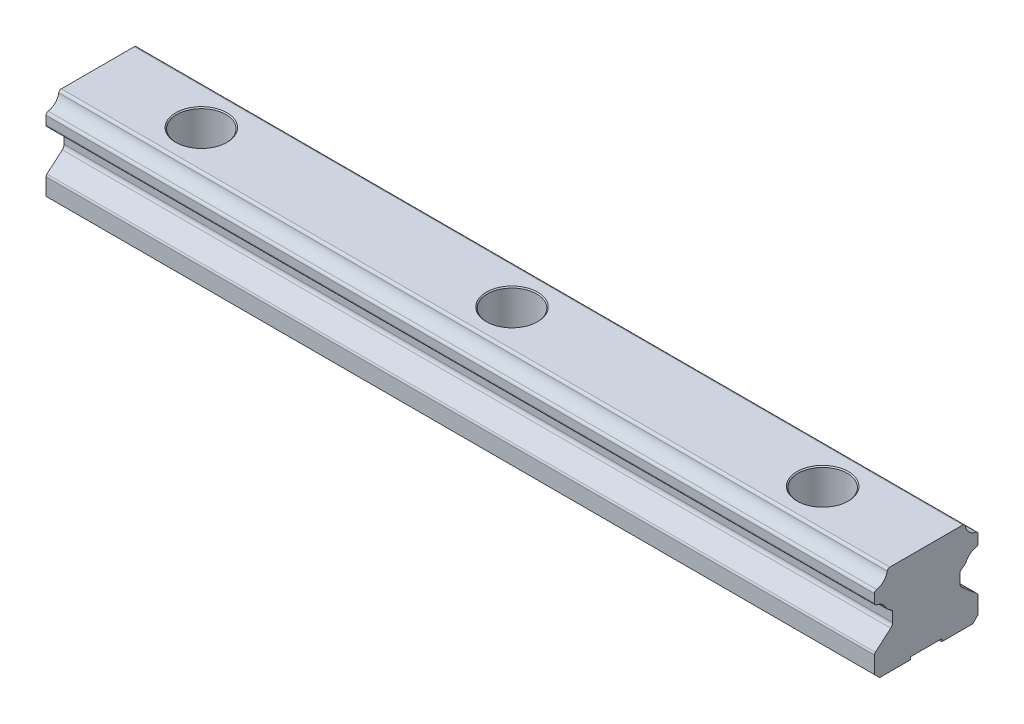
ISO-10303-21;
HEADER;
FILE_DESCRIPTION(('STEP AP214'),'2;1');
FILE_NAME('part.step','',(''),(''),'','','');
FILE_SCHEMA(('AUTOMOTIVE_DESIGN { 1 0 10303 214 1 1 1 1 }'));
ENDSEC;
DATA;
#1=APPLICATION_CONTEXT('core data for automotive mechanical design processes');
#2=APPLICATION_PROTOCOL_DEFINITION('international standard','automotive_design',2000,#1);
#3=PRODUCT_CONTEXT('',#1,'mechanical');
#4=PRODUCT('Part','Part','',(#3));
#5=PRODUCT_RELATED_PRODUCT_CATEGORY('part','',(#4));
#6=PRODUCT_DEFINITION_FORMATION('','',#4);
#7=PRODUCT_DEFINITION_CONTEXT('part definition',#1,'design');
#8=PRODUCT_DEFINITION('design','',#6,#7);
#9=PRODUCT_DEFINITION_SHAPE('','',#8);
#10=(LENGTH_UNIT() NAMED_UNIT(*) SI_UNIT(.MILLI.,.METRE.));
#11=(NAMED_UNIT(*) PLANE_ANGLE_UNIT() SI_UNIT($,.RADIAN.));
#12=(NAMED_UNIT(*) SI_UNIT($,.STERADIAN.) SOLID_ANGLE_UNIT());
#13=UNCERTAINTY_MEASURE_WITH_UNIT(LENGTH_MEASURE(1.E-05),#10,'distance_accuracy_value','');
#14=(GEOMETRIC_REPRESENTATION_CONTEXT(3) GLOBAL_UNCERTAINTY_ASSIGNED_CONTEXT((#13)) GLOBAL_UNIT_ASSIGNED_CONTEXT((#10,
#11,#12)) REPRESENTATION_CONTEXT('',''));
#15=CARTESIAN_POINT('',(0.,0.,0.));
#16=DIRECTION('',(0.,0.,1.));
#17=DIRECTION('',(1.,0.,0.));
#18=AXIS2_PLACEMENT_3D('',#15,#16,#17);
#19=CARTESIAN_POINT('',(160.,0.,-3.));
#20=DIRECTION('',(0.,0.,1.));
#21=DIRECTION('',(1.,0.,0.));
#22=AXIS2_PLACEMENT_3D('',#19,#20,#21);
#23=PLANE('',#22);
#24=DIRECTION('',(-1.,0.,0.));
#25=VECTOR('',#24,1.);
#26=CARTESIAN_POINT('',(160.,0.5,-3.));
#27=LINE('',#26,#25);
#28=CARTESIAN_POINT('',(19.8267227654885,0.5,-3.));
#29=VERTEX_POINT('',#28);
#30=CARTESIAN_POINT('',(0.,0.5,-3.));
#31=VERTEX_POINT('',#30);
#32=EDGE_CURVE('E11',#29,#31,#27,.T.);
#33=ORIENTED_EDGE('',*,*,#32,.T.);
#34=DIRECTION('',(0.,1.,0.));
#35=VECTOR('',#34,1.);
#36=CARTESIAN_POINT('',(0.,0.,-3.));
#37=LINE('',#36,#35);
#38=CARTESIAN_POINT('',(0.,0.,-3.));
#39=VERTEX_POINT('',#38);
#40=EDGE_CURVE('E43',#39,#31,#37,.T.);
#41=ORIENTED_EDGE('',*,*,#40,.F.);
#42=DIRECTION('',(-1.,0.,0.));
#43=VECTOR('',#42,1.);
#44=CARTESIAN_POINT('',(160.,0.,-3.));
#45=LINE('',#44,#43);
#46=CARTESIAN_POINT('',(18.8721591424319,0.,-3.));
#47=VERTEX_POINT('',#46);
#48=EDGE_CURVE('E1011',#47,#39,#45,.T.);
#49=ORIENTED_EDGE('',*,*,#48,.F.);
#50=CARTESIAN_POINT('',(19.8267227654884,0.200000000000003,-3.));
#51=CARTESIAN_POINT('',(19.7862661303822,0.197672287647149,-2.99999781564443));
#52=CARTESIAN_POINT('',(19.745857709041,0.194530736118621,-2.99999212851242));
#53=CARTESIAN_POINT('',(19.6650815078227,0.186648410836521,-2.99998189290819));
#54=CARTESIAN_POINT('',(19.624714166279,0.1819031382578,-2.99997734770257));
#55=CARTESIAN_POINT('',(19.5438964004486,0.170814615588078,-2.9999776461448));
#56=CARTESIAN_POINT('',(19.5034475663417,0.164459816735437,-2.99998255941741));
#57=CARTESIAN_POINT('',(19.4223437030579,0.150161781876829,-2.99999357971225));
#58=CARTESIAN_POINT('',(19.3816918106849,0.14220080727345,-2.99999970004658));
#59=CARTESIAN_POINT('',(19.3021918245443,0.125148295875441,-3.00000028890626));
#60=CARTESIAN_POINT('',(19.2633324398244,0.116109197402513,-2.99999517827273));
#61=CARTESIAN_POINT('',(19.185514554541,0.0966435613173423,-2.99998797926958));
#62=CARTESIAN_POINT('',(19.1465595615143,0.0862030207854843,-2.99998592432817));
#63=CARTESIAN_POINT('',(19.068461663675,0.0639391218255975,-2.99998669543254));
#64=CARTESIAN_POINT('',(19.0293236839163,0.0520985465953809,-2.99998958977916));
#65=CARTESIAN_POINT('',(18.9507728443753,0.0270378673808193,-2.99999575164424));
#66=CARTESIAN_POINT('',(18.9113662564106,0.0137980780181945,-2.99999902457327));
#67=CARTESIAN_POINT('',(18.8721591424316,5.71510070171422E-13,-3.00000000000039));
#68=B_SPLINE_CURVE_WITH_KNOTS('',3,(#50,#51,#52,#53,#54,#55,#56,#57,#58,#59,#60,#61,#62,#63,#64,
#65,#66,#67),.UNSPECIFIED.,.F.,.F.,(4,2,2,2,2,2,2,2,4),(0.,0.121560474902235,0.243464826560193,
0.366269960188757,0.490513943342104,0.610181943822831,0.731149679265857,0.853800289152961,
0.978492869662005),.UNSPECIFIED.);
#69=CARTESIAN_POINT('',(19.8267227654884,0.2000000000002,-3.));
#70=VERTEX_POINT('',#69);
#71=EDGE_CURVE('E977',#70,#47,#68,.T.);
#72=ORIENTED_EDGE('',*,*,#71,.F.);
#73=DIRECTION('',(0.,-1.,0.));
#74=VECTOR('',#73,1.);
#75=CARTESIAN_POINT('',(19.8267227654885,0.,-3.));
#76=LINE('',#75,#74);
#77=EDGE_CURVE('E1147',#29,#70,#76,.T.);
#78=ORIENTED_EDGE('',*,*,#77,.F.);
#79=EDGE_LOOP('',(#33,#41,#49,#72,#78));
#80=FACE_BOUND('',#79,.T.);
#81=ADVANCED_FACE('F17',(#80),#23,.T.);
#82=CARTESIAN_POINT('',(80.,0.2,0.));
#83=DIRECTION('',(0.,-1.,0.));
#84=DIRECTION('',(0.,0.,-1.));
#85=AXIS2_PLACEMENT_3D('',#82,#83,#84);
#86=CONICAL_SURFACE('',#85,3.005,0.7853981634);
#87=CARTESIAN_POINT('',(80.,0.,0.));
#88=DIRECTION('',(0.,-1.,0.));
#89=DIRECTION('',(0.,0.,-1.));
#90=AXIS2_PLACEMENT_3D('',#87,#88,#89);
#91=CIRCLE('',#90,3.205);
#92=CARTESIAN_POINT('',(81.1278408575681,0.,3.));
#93=VERTEX_POINT('',#92);
#94=CARTESIAN_POINT('',(78.8721591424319,0.,3.));
#95=VERTEX_POINT('',#94);
#96=EDGE_CURVE('E29',#93,#95,#91,.T.);
#97=ORIENTED_EDGE('',*,*,#96,.T.);
#98=CARTESIAN_POINT('',(78.8721591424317,5.14508140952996E-13,3.00000000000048));
#99=CARTESIAN_POINT('',(78.9113570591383,0.0137952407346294,2.99999882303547));
#100=CARTESIAN_POINT('',(78.9507580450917,0.0270209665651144,3.0000085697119));
#101=CARTESIAN_POINT('',(79.0294073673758,0.052076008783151,3.000041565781));
#102=CARTESIAN_POINT('',(79.0686504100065,0.0639219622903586,3.00006462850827));
#103=CARTESIAN_POINT('',(79.1470660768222,0.086218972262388,3.00011603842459));
#104=CARTESIAN_POINT('',(79.1862347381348,0.0966839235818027,3.00014432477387));
#105=CARTESIAN_POINT('',(79.2645855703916,0.116220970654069,3.00019150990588));
#106=CARTESIAN_POINT('',(79.3037651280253,0.125303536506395,3.00021048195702));
#107=CARTESIAN_POINT('',(79.3835989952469,0.142377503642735,3.000212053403));
#108=CARTESIAN_POINT('',(79.4242621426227,0.150327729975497,3.00019353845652));
#109=CARTESIAN_POINT('',(79.5052760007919,0.164597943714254,3.00014335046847));
#110=CARTESIAN_POINT('',(79.5456228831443,0.170939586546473,3.00011186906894));
#111=CARTESIAN_POINT('',(79.6261246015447,0.181994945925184,3.00005813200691));
#112=CARTESIAN_POINT('',(79.6662772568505,0.186724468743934,3.00003578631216));
#113=CARTESIAN_POINT('',(79.7465118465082,0.194568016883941,3.00000568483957));
#114=CARTESIAN_POINT('',(79.7865929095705,0.197690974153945,2.9999978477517));
#115=CARTESIAN_POINT('',(79.8267227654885,0.200000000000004,3.));
#116=B_SPLINE_CURVE_WITH_KNOTS('',3,(#98,#99,#100,#101,#102,#103,#104,#105,#106,#107,#108,#109,
#110,#111,#112,#113,#114,#115),.UNSPECIFIED.,.F.,.F.,(4,2,2,2,2,2,2,2,4),(0.,0.12466305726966,
0.247619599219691,0.36922531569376,0.489858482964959,0.614130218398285,0.736627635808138,
0.857886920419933,0.978464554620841),.UNSPECIFIED.);
#117=CARTESIAN_POINT('',(79.8267227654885,0.2,3.));
#118=VERTEX_POINT('',#117);
#119=EDGE_CURVE('E495',#95,#118,#116,.T.);
#120=ORIENTED_EDGE('',*,*,#119,.T.);
#121=CARTESIAN_POINT('',(80.,0.2,0.));
#122=DIRECTION('',(0.,-1.,0.));
#123=DIRECTION('',(0.,0.,-1.));
#124=AXIS2_PLACEMENT_3D('',#121,#122,#123);
#125=CIRCLE('',#124,3.005);
#126=CARTESIAN_POINT('',(80.1732772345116,0.2000000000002,3.));
#127=VERTEX_POINT('',#126);
#128=EDGE_CURVE('E1661',#127,#118,#125,.T.);
#129=ORIENTED_EDGE('',*,*,#128,.F.);
#130=CARTESIAN_POINT('',(80.1732772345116,0.200000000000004,3.));
#131=CARTESIAN_POINT('',(80.2137338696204,0.197672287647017,2.99999781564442));
#132=CARTESIAN_POINT('',(80.254142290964,0.194530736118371,2.99999212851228));
#133=CARTESIAN_POINT('',(80.3349184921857,0.186648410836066,2.99998189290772));
#134=CARTESIAN_POINT('',(80.3752858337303,0.181903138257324,2.9999773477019));
#135=CARTESIAN_POINT('',(80.4561035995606,0.170814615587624,2.99997764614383));
#136=CARTESIAN_POINT('',(80.4965524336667,0.16445981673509,2.99998255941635));
#137=CARTESIAN_POINT('',(80.5776562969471,0.150161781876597,2.99999357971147));
#138=CARTESIAN_POINT('',(80.6183081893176,0.142200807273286,2.99999970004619));
#139=CARTESIAN_POINT('',(80.6978081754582,0.125148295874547,3.00000028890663));
#140=CARTESIAN_POINT('',(80.7366675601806,0.116109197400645,2.99999517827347));
#141=CARTESIAN_POINT('',(80.8144854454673,0.0966435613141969,2.9999879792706));
#142=CARTESIAN_POINT('',(80.8534404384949,0.0862030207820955,2.9999859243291));
#143=CARTESIAN_POINT('',(80.9315383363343,0.0639391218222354,2.99998669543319));
#144=CARTESIAN_POINT('',(80.9706763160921,0.0520985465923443,2.99998958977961));
#145=CARTESIAN_POINT('',(81.0492271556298,0.0270378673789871,2.99999575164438));
#146=CARTESIAN_POINT('',(81.0886337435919,0.0137980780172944,2.99999902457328));
#147=CARTESIAN_POINT('',(81.1278408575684,5.69992187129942E-13,3.00000000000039));
#148=B_SPLINE_CURVE_WITH_KNOTS('',3,(#130,#131,#132,#133,#134,#135,#136,#137,#138,#139,#140,
#141,#142,#143,#144,#145,#146,#147),.UNSPECIFIED.,.F.,.F.,(4,2,2,2,2,2,2,2,4),(0.,
0.121560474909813,0.24346482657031,0.366269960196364,0.490513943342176,0.610181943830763,
0.731149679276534,0.853800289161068,0.978492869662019),.UNSPECIFIED.);
#149=EDGE_CURVE('E1585',#127,#93,#148,.T.);
#150=ORIENTED_EDGE('',*,*,#149,.T.);
#151=EDGE_LOOP('',(#97,#120,#129,#150));
#152=FACE_BOUND('',#151,.T.);
#153=ADVANCED_FACE('F19',(#152),#86,.F.);
#154=CARTESIAN_POINT('',(20.,0.2,0.));
#155=DIRECTION('',(0.,-1.,0.));
#156=DIRECTION('',(0.,0.,-1.));
#157=AXIS2_PLACEMENT_3D('',#154,#155,#156);
#158=CONICAL_SURFACE('',#157,3.005,0.7853981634);
#159=CARTESIAN_POINT('',(20.,0.,0.));
#160=DIRECTION('',(0.,-1.,0.));
#161=DIRECTION('',(0.,0.,-1.));
#162=AXIS2_PLACEMENT_3D('',#159,#160,#161);
#163=CIRCLE('',#162,3.205);
#164=CARTESIAN_POINT('',(21.1278408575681,0.,3.));
#165=VERTEX_POINT('',#164);
#166=CARTESIAN_POINT('',(18.8721591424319,0.,3.));
#167=VERTEX_POINT('',#166);
#168=EDGE_CURVE('E1576',#165,#167,#163,.T.);
#169=ORIENTED_EDGE('',*,*,#168,.T.);
#170=CARTESIAN_POINT('',(18.8721591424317,5.15998918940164E-13,3.00000000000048));
#171=CARTESIAN_POINT('',(18.9113570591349,0.0137952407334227,2.99999882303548));
#172=CARTESIAN_POINT('',(18.9507580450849,0.027020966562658,3.00000856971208));
#173=CARTESIAN_POINT('',(19.0294073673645,0.0520760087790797,3.00004156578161));
#174=CARTESIAN_POINT('',(19.0686504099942,0.0639219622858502,3.00006462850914));
#175=CARTESIAN_POINT('',(19.1470660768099,0.0862189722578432,3.00011603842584));
#176=CARTESIAN_POINT('',(19.1862347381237,0.096683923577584,3.00014432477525));
#177=CARTESIAN_POINT('',(19.264585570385,0.11622097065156,3.00019150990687));
#178=CARTESIAN_POINT('',(19.303765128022,0.125303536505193,3.00021048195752));
#179=CARTESIAN_POINT('',(19.3835989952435,0.142377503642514,3.00021205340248));
#180=CARTESIAN_POINT('',(19.4242621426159,0.150327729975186,3.00019353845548));
#181=CARTESIAN_POINT('',(19.5052760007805,0.164597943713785,3.00014335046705));
#182=CARTESIAN_POINT('',(19.5456228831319,0.170939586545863,3.00011186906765));
#183=CARTESIAN_POINT('',(19.6261246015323,0.181994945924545,3.00005813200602));
#184=CARTESIAN_POINT('',(19.6662772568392,0.186724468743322,3.00003578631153));
#185=CARTESIAN_POINT('',(19.7465118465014,0.194568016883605,3.00000568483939));
#186=CARTESIAN_POINT('',(19.7865929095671,0.197690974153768,2.99999784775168));
#187=CARTESIAN_POINT('',(19.8267227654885,0.200000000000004,3.));
#188=B_SPLINE_CURVE_WITH_KNOTS('',3,(#170,#171,#172,#173,#174,#175,#176,#177,#178,#179,#180,
#181,#182,#183,#184,#185,#186,#187),.UNSPECIFIED.,.F.,.F.,(4,2,2,2,2,2,2,2,4),(0.,
0.124663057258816,0.247619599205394,0.369225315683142,0.489858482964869,0.614130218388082,
0.73662763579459,0.857886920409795,0.978464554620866),.UNSPECIFIED.);
#189=CARTESIAN_POINT('',(19.8267227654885,0.2,3.));
#190=VERTEX_POINT('',#189);
#191=EDGE_CURVE('E1586',#167,#190,#188,.T.);
#192=ORIENTED_EDGE('',*,*,#191,.T.);
#193=CARTESIAN_POINT('',(20.,0.2,0.));
#194=DIRECTION('',(0.,-1.,0.));
#195=DIRECTION('',(0.,0.,-1.));
#196=AXIS2_PLACEMENT_3D('',#193,#194,#195);
#197=CIRCLE('',#196,3.005);
#198=CARTESIAN_POINT('',(20.1732772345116,0.2000000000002,3.));
#199=VERTEX_POINT('',#198);
#200=EDGE_CURVE('E548',#199,#190,#197,.T.);
#201=ORIENTED_EDGE('',*,*,#200,.F.);
#202=CARTESIAN_POINT('',(20.1732772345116,0.200000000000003,3.));
#203=CARTESIAN_POINT('',(20.2137338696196,0.197672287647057,2.99999781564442));
#204=CARTESIAN_POINT('',(20.2541422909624,0.194530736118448,2.99999212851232));
#205=CARTESIAN_POINT('',(20.3349184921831,0.186648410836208,2.99998189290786));
#206=CARTESIAN_POINT('',(20.3752858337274,0.181903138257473,2.99997734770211));
#207=CARTESIAN_POINT('',(20.4561035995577,0.170814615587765,2.99997764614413));
#208=CARTESIAN_POINT('',(20.4965524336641,0.164459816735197,2.99998255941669));
#209=CARTESIAN_POINT('',(20.5776562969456,0.150161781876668,2.99999357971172));
#210=CARTESIAN_POINT('',(20.6183081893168,0.142200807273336,2.99999970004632));
#211=CARTESIAN_POINT('',(20.6978081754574,0.125148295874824,3.00000028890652));
#212=CARTESIAN_POINT('',(20.736667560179,0.116109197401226,2.99999517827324));
#213=CARTESIAN_POINT('',(20.8144854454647,0.0966435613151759,2.99998797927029));
#214=CARTESIAN_POINT('',(20.853440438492,0.0862030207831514,2.99998592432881));
#215=CARTESIAN_POINT('',(20.9315383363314,0.0639391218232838,2.99998669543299));
#216=CARTESIAN_POINT('',(20.9706763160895,0.052098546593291,2.99998958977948));
#217=CARTESIAN_POINT('',(21.0492271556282,0.0270378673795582,2.99999575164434));
#218=CARTESIAN_POINT('',(21.0886337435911,0.0137980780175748,2.99999902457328));
#219=CARTESIAN_POINT('',(21.1278408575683,5.71510070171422E-13,3.0000000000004));
#220=B_SPLINE_CURVE_WITH_KNOTS('',3,(#202,#203,#204,#205,#206,#207,#208,#209,#210,#211,#212,
#213,#214,#215,#216,#217,#218,#219),.UNSPECIFIED.,.F.,.F.,(4,2,2,2,2,2,2,2,4),(0.,
0.121560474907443,0.243464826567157,0.366269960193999,0.49051394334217,0.610181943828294,
0.731149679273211,0.85380028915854,0.978492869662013),.UNSPECIFIED.);
#221=EDGE_CURVE('E816',#199,#165,#220,.T.);
#222=ORIENTED_EDGE('',*,*,#221,.T.);
#223=EDGE_LOOP('',(#169,#192,#201,#222));
#224=FACE_BOUND('',#223,.T.);
#225=ADVANCED_FACE('F525',(#224),#158,.F.);
#226=CARTESIAN_POINT('',(20.,0.,0.));
#227=DIRECTION('',(0.,1.,0.));
#228=DIRECTION('',(0.,0.,-1.));
#229=AXIS2_PLACEMENT_3D('',#226,#227,#228);
#230=CYLINDRICAL_SURFACE('',#229,3.005);
#231=CARTESIAN_POINT('',(20.,9.,0.));
#232=DIRECTION('',(0.,-1.,0.));
#233=DIRECTION('',(0.,0.,-1.));
#234=AXIS2_PLACEMENT_3D('',#231,#232,#233);
#235=CIRCLE('',#234,3.005);
#236=CARTESIAN_POINT('',(20.,9.,-3.005));
#237=VERTEX_POINT('',#236);
#238=EDGE_CURVE('E939',#237,#237,#235,.T.);
#239=ORIENTED_EDGE('',*,*,#238,.F.);
#240=EDGE_LOOP('',(#239));
#241=FACE_BOUND('',#240,.T.);
#242=CARTESIAN_POINT('',(20.,0.5,0.));
#243=DIRECTION('',(0.,-1.,0.));
#244=DIRECTION('',(0.,0.,-1.));
#245=AXIS2_PLACEMENT_3D('',#242,#243,#244);
#246=CIRCLE('',#245,3.005);
#247=CARTESIAN_POINT('',(20.1732772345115,0.5,-3.));
#248=VERTEX_POINT('',#247);
#249=CARTESIAN_POINT('',(20.1732772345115,0.5,3.));
#250=VERTEX_POINT('',#249);
#251=EDGE_CURVE('E547',#248,#250,#246,.T.);
#252=ORIENTED_EDGE('',*,*,#251,.T.);
#253=DIRECTION('',(0.,-1.,0.));
#254=VECTOR('',#253,1.);
#255=CARTESIAN_POINT('',(20.1732772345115,0.,3.));
#256=LINE('',#255,#254);
#257=EDGE_CURVE('E538',#250,#199,#256,.T.);
#258=ORIENTED_EDGE('',*,*,#257,.T.);
#259=ORIENTED_EDGE('',*,*,#200,.T.);
#260=DIRECTION('',(0.,1.,0.));
#261=VECTOR('',#260,1.);
#262=CARTESIAN_POINT('',(19.8267227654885,0.,3.));
#263=LINE('',#262,#261);
#264=CARTESIAN_POINT('',(19.8267227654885,0.5,3.));
#265=VERTEX_POINT('',#264);
#266=EDGE_CURVE('E1146',#190,#265,#263,.T.);
#267=ORIENTED_EDGE('',*,*,#266,.T.);
#268=CARTESIAN_POINT('',(20.,0.5,0.));
#269=DIRECTION('',(0.,-1.,0.));
#270=DIRECTION('',(0.,0.,-1.));
#271=AXIS2_PLACEMENT_3D('',#268,#269,#270);
#272=CIRCLE('',#271,3.005);
#273=EDGE_CURVE('E1142',#265,#29,#272,.T.);
#274=ORIENTED_EDGE('',*,*,#273,.T.);
#275=ORIENTED_EDGE('',*,*,#77,.T.);
#276=CARTESIAN_POINT('',(20.,0.2,0.));
#277=DIRECTION('',(0.,-1.,0.));
#278=DIRECTION('',(0.,0.,-1.));
#279=AXIS2_PLACEMENT_3D('',#276,#277,#278);
#280=CIRCLE('',#279,3.005);
#281=CARTESIAN_POINT('',(20.1732772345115,0.2,-3.));
#282=VERTEX_POINT('',#281);
#283=EDGE_CURVE('E1269',#70,#282,#280,.T.);
#284=ORIENTED_EDGE('',*,*,#283,.T.);
#285=DIRECTION('',(0.,1.,0.));
#286=VECTOR('',#285,1.);
#287=CARTESIAN_POINT('',(20.1732772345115,0.,-3.));
#288=LINE('',#287,#286);
#289=EDGE_CURVE('E1068',#282,#248,#288,.T.);
#290=ORIENTED_EDGE('',*,*,#289,.T.);
#291=EDGE_LOOP('',(#252,#258,#259,#267,#274,#275,#284,#290));
#292=FACE_BOUND('',#291,.T.);
#293=ADVANCED_FACE('F705',(#241,#292),#230,.F.);
#294=CARTESIAN_POINT('',(24.755,9.,0.));
#295=DIRECTION('',(0.,1.,0.));
#296=DIRECTION('',(1.,0.,0.));
#297=AXIS2_PLACEMENT_3D('',#294,#295,#296);
#298=PLANE('',#297);
#299=CARTESIAN_POINT('',(20.,9.,0.));
#300=DIRECTION('',(0.,-1.,0.));
#301=DIRECTION('',(0.,0.,-1.));
#302=AXIS2_PLACEMENT_3D('',#299,#300,#301);
#303=CIRCLE('',#302,4.755);
#304=CARTESIAN_POINT('',(20.,9.,-4.755));
#305=VERTEX_POINT('',#304);
#306=EDGE_CURVE('E935',#305,#305,#303,.T.);
#307=ORIENTED_EDGE('',*,*,#306,.F.);
#308=EDGE_LOOP('',(#307));
#309=FACE_BOUND('',#308,.T.);
#310=ORIENTED_EDGE('',*,*,#238,.T.);
#311=EDGE_LOOP('',(#310));
#312=FACE_BOUND('',#311,.T.);
#313=ADVANCED_FACE('F1760',(#309,#312),#298,.T.);
#314=CARTESIAN_POINT('',(20.,0.,0.));
#315=DIRECTION('',(0.,1.,0.));
#316=DIRECTION('',(0.,0.,-1.));
#317=AXIS2_PLACEMENT_3D('',#314,#315,#316);
#318=CYLINDRICAL_SURFACE('',#317,4.755);
#319=CARTESIAN_POINT('',(20.,17.3,0.));
#320=DIRECTION('',(0.,-1.,0.));
#321=DIRECTION('',(0.,0.,-1.));
#322=AXIS2_PLACEMENT_3D('',#319,#320,#321);
#323=CIRCLE('',#322,4.755);
#324=CARTESIAN_POINT('',(20.,17.3,-4.755));
#325=VERTEX_POINT('',#324);
#326=EDGE_CURVE('E916',#325,#325,#323,.T.);
#327=ORIENTED_EDGE('',*,*,#326,.F.);
#328=EDGE_LOOP('',(#327));
#329=FACE_BOUND('',#328,.T.);
#330=ORIENTED_EDGE('',*,*,#306,.T.);
#331=EDGE_LOOP('',(#330));
#332=FACE_BOUND('',#331,.T.);
#333=ADVANCED_FACE('F1766',(#329,#332),#318,.F.);
#334=CARTESIAN_POINT('',(20.,17.5,0.));
#335=DIRECTION('',(0.,1.,0.));
#336=DIRECTION('',(0.,0.,1.));
#337=AXIS2_PLACEMENT_3D('',#334,#335,#336);
#338=CONICAL_SURFACE('',#337,4.955,0.7853981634);
#339=CARTESIAN_POINT('',(20.,17.5,0.));
#340=DIRECTION('',(0.,-1.,0.));
#341=DIRECTION('',(0.,0.,-1.));
#342=AXIS2_PLACEMENT_3D('',#339,#340,#341);
#343=CIRCLE('',#342,4.955);
#344=CARTESIAN_POINT('',(20.,17.5,-4.955));
#345=VERTEX_POINT('',#344);
#346=EDGE_CURVE('E429',#345,#345,#343,.T.);
#347=ORIENTED_EDGE('',*,*,#346,.F.);
#348=EDGE_LOOP('',(#347));
#349=FACE_BOUND('',#348,.T.);
#350=ORIENTED_EDGE('',*,*,#326,.T.);
#351=EDGE_LOOP('',(#350));
#352=FACE_BOUND('',#351,.T.);
#353=ADVANCED_FACE('F1332',(#349,#352),#338,.F.);
#354=CARTESIAN_POINT('',(144.755,9.,0.));
#355=DIRECTION('',(0.,1.,0.));
#356=DIRECTION('',(1.,0.,0.));
#357=AXIS2_PLACEMENT_3D('',#354,#355,#356);
#358=PLANE('',#357);
#359=CARTESIAN_POINT('',(140.,9.,0.));
#360=DIRECTION('',(0.,-1.,0.));
#361=DIRECTION('',(0.,0.,-1.));
#362=AXIS2_PLACEMENT_3D('',#359,#360,#361);
#363=CIRCLE('',#362,4.755);
#364=CARTESIAN_POINT('',(140.,9.,-4.755));
#365=VERTEX_POINT('',#364);
#366=EDGE_CURVE('E760',#365,#365,#363,.T.);
#367=ORIENTED_EDGE('',*,*,#366,.F.);
#368=EDGE_LOOP('',(#367));
#369=FACE_BOUND('',#368,.T.);
#370=CARTESIAN_POINT('',(140.,9.,0.));
#371=DIRECTION('',(0.,-1.,0.));
#372=DIRECTION('',(0.,0.,-1.));
#373=AXIS2_PLACEMENT_3D('',#370,#371,#372);
#374=CIRCLE('',#373,3.005);
#375=CARTESIAN_POINT('',(140.,9.,-3.005));
#376=VERTEX_POINT('',#375);
#377=EDGE_CURVE('E912',#376,#376,#374,.T.);
#378=ORIENTED_EDGE('',*,*,#377,.T.);
#379=EDGE_LOOP('',(#378));
#380=FACE_BOUND('',#379,.T.);
#381=ADVANCED_FACE('F625',(#369,#380),#358,.T.);
#382=CARTESIAN_POINT('',(160.,0.,9.));
#383=DIRECTION('',(0.,1.,0.));
#384=DIRECTION('',(1.,0.,0.));
#385=AXIS2_PLACEMENT_3D('',#382,#383,#384);
#386=PLANE('',#385);
#387=DIRECTION('',(-1.,0.,0.));
#388=VECTOR('',#387,1.);
#389=CARTESIAN_POINT('',(160.,0.,3.));
#390=LINE('',#389,#388);
#391=CARTESIAN_POINT('',(160.,0.,3.));
#392=VERTEX_POINT('',#391);
#393=CARTESIAN_POINT('',(141.127840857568,0.,3.));
#394=VERTEX_POINT('',#393);
#395=EDGE_CURVE('E301',#392,#394,#390,.T.);
#396=ORIENTED_EDGE('',*,*,#395,.F.);
#397=DIRECTION('',(0.,0.,-1.));
#398=VECTOR('',#397,1.);
#399=CARTESIAN_POINT('',(160.,0.,9.));
#400=LINE('',#399,#398);
#401=CARTESIAN_POINT('',(160.,0.,9.));
#402=VERTEX_POINT('',#401);
#403=EDGE_CURVE('E312',#402,#392,#400,.T.);
#404=ORIENTED_EDGE('',*,*,#403,.F.);
#405=DIRECTION('',(-1.,0.,0.));
#406=VECTOR('',#405,1.);
#407=CARTESIAN_POINT('',(160.,0.,9.));
#408=LINE('',#407,#406);
#409=CARTESIAN_POINT('',(0.,0.,9.));
#410=VERTEX_POINT('',#409);
#411=EDGE_CURVE('E917',#402,#410,#408,.T.);
#412=ORIENTED_EDGE('',*,*,#411,.T.);
#413=DIRECTION('',(0.,0.,-1.));
#414=VECTOR('',#413,1.);
#415=CARTESIAN_POINT('',(0.,0.,9.));
#416=LINE('',#415,#414);
#417=CARTESIAN_POINT('',(0.,0.,3.));
#418=VERTEX_POINT('',#417);
#419=EDGE_CURVE('E1088',#410,#418,#416,.T.);
#420=ORIENTED_EDGE('',*,*,#419,.T.);
#421=DIRECTION('',(-1.,0.,0.));
#422=VECTOR('',#421,1.);
#423=CARTESIAN_POINT('',(160.,0.,3.));
#424=LINE('',#423,#422);
#425=EDGE_CURVE('E952',#167,#418,#424,.T.);
#426=ORIENTED_EDGE('',*,*,#425,.F.);
#427=ORIENTED_EDGE('',*,*,#168,.F.);
#428=DIRECTION('',(-1.,0.,0.));
#429=VECTOR('',#428,1.);
#430=CARTESIAN_POINT('',(160.,0.,3.));
#431=LINE('',#430,#429);
#432=EDGE_CURVE('E1284',#95,#165,#431,.T.);
#433=ORIENTED_EDGE('',*,*,#432,.F.);
#434=ORIENTED_EDGE('',*,*,#96,.F.);
#435=DIRECTION('',(-1.,0.,0.));
#436=VECTOR('',#435,1.);
#437=CARTESIAN_POINT('',(160.,0.,3.));
#438=LINE('',#437,#436);
#439=CARTESIAN_POINT('',(138.872159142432,0.,3.));
#440=VERTEX_POINT('',#439);
#441=EDGE_CURVE('E883',#440,#93,#438,.T.);
#442=ORIENTED_EDGE('',*,*,#441,.F.);
#443=CARTESIAN_POINT('',(140.,0.,0.));
#444=DIRECTION('',(0.,-1.,0.));
#445=DIRECTION('',(0.,0.,-1.));
#446=AXIS2_PLACEMENT_3D('',#443,#444,#445);
#447=CIRCLE('',#446,3.205);
#448=EDGE_CURVE('E1075',#394,#440,#447,.T.);
#449=ORIENTED_EDGE('',*,*,#448,.F.);
#450=EDGE_LOOP('',(#396,#404,#412,#420,#426,#427,#433,#434,#442,#449));
#451=FACE_BOUND('',#450,.T.);
#452=ADVANCED_FACE('F622',(#451),#386,.F.);
#453=CARTESIAN_POINT('',(160.,0.,9.));
#454=DIRECTION('',(0.,1.,0.));
#455=DIRECTION('',(1.,0.,0.));
#456=AXIS2_PLACEMENT_3D('',#453,#454,#455);
#457=PLANE('',#456);
#458=ORIENTED_EDGE('',*,*,#48,.T.);
#459=DIRECTION('',(0.,0.,-1.));
#460=VECTOR('',#459,1.);
#461=CARTESIAN_POINT('',(0.,0.,9.));
#462=LINE('',#461,#460);
#463=CARTESIAN_POINT('',(0.,0.,-9.));
#464=VERTEX_POINT('',#463);
#465=EDGE_CURVE('E666',#39,#464,#462,.T.);
#466=ORIENTED_EDGE('',*,*,#465,.T.);
#467=DIRECTION('',(-1.,0.,0.));
#468=VECTOR('',#467,1.);
#469=CARTESIAN_POINT('',(160.,0.,-9.));
#470=LINE('',#469,#468);
#471=CARTESIAN_POINT('',(160.,0.,-9.));
#472=VERTEX_POINT('',#471);
#473=EDGE_CURVE('E476',#472,#464,#470,.T.);
#474=ORIENTED_EDGE('',*,*,#473,.F.);
#475=DIRECTION('',(0.,0.,-1.));
#476=VECTOR('',#475,1.);
#477=CARTESIAN_POINT('',(160.,0.,9.));
#478=LINE('',#477,#476);
#479=CARTESIAN_POINT('',(160.,0.,-3.));
#480=VERTEX_POINT('',#479);
#481=EDGE_CURVE('E755',#480,#472,#478,.T.);
#482=ORIENTED_EDGE('',*,*,#481,.F.);
#483=DIRECTION('',(-1.,0.,0.));
#484=VECTOR('',#483,1.);
#485=CARTESIAN_POINT('',(160.,0.,-3.));
#486=LINE('',#485,#484);
#487=CARTESIAN_POINT('',(141.127840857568,0.,-3.));
#488=VERTEX_POINT('',#487);
#489=EDGE_CURVE('E662',#480,#488,#486,.T.);
#490=ORIENTED_EDGE('',*,*,#489,.T.);
#491=CARTESIAN_POINT('',(140.,0.,0.));
#492=DIRECTION('',(0.,-1.,0.));
#493=DIRECTION('',(0.,0.,-1.));
#494=AXIS2_PLACEMENT_3D('',#491,#492,#493);
#495=CIRCLE('',#494,3.205);
#496=CARTESIAN_POINT('',(138.872159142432,0.,-3.));
#497=VERTEX_POINT('',#496);
#498=EDGE_CURVE('E651',#497,#488,#495,.T.);
#499=ORIENTED_EDGE('',*,*,#498,.F.);
#500=DIRECTION('',(-1.,0.,0.));
#501=VECTOR('',#500,1.);
#502=CARTESIAN_POINT('',(160.,0.,-3.));
#503=LINE('',#502,#501);
#504=CARTESIAN_POINT('',(81.1278408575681,0.,-3.));
#505=VERTEX_POINT('',#504);
#506=EDGE_CURVE('E667',#497,#505,#503,.T.);
#507=ORIENTED_EDGE('',*,*,#506,.T.);
#508=CARTESIAN_POINT('',(80.,0.,0.));
#509=DIRECTION('',(0.,-1.,0.));
#510=DIRECTION('',(0.,0.,-1.));
#511=AXIS2_PLACEMENT_3D('',#508,#509,#510);
#512=CIRCLE('',#511,3.205);
#513=CARTESIAN_POINT('',(78.8721591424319,0.,-3.));
#514=VERTEX_POINT('',#513);
#515=EDGE_CURVE('E680',#514,#505,#512,.T.);
#516=ORIENTED_EDGE('',*,*,#515,.F.);
#517=DIRECTION('',(-1.,0.,0.));
#518=VECTOR('',#517,1.);
#519=CARTESIAN_POINT('',(160.,0.,-3.));
#520=LINE('',#519,#518);
#521=CARTESIAN_POINT('',(21.1278408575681,0.,-3.));
#522=VERTEX_POINT('',#521);
#523=EDGE_CURVE('E1150',#514,#522,#520,.T.);
#524=ORIENTED_EDGE('',*,*,#523,.T.);
#525=CARTESIAN_POINT('',(20.,0.,0.));
#526=DIRECTION('',(0.,-1.,0.));
#527=DIRECTION('',(0.,0.,-1.));
#528=AXIS2_PLACEMENT_3D('',#525,#526,#527);
#529=CIRCLE('',#528,3.205);
#530=EDGE_CURVE('E1266',#47,#522,#529,.T.);
#531=ORIENTED_EDGE('',*,*,#530,.F.);
#532=EDGE_LOOP('',(#458,#466,#474,#482,#490,#499,#507,#516,#524,#531));
#533=FACE_BOUND('',#532,.T.);
#534=ADVANCED_FACE('F575',(#533),#457,.F.);
#535=CARTESIAN_POINT('',(160.,1.,10.));
#536=DIRECTION('',(0.,0.707106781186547,-0.707106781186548));
#537=DIRECTION('',(-1.,0.,0.));
#538=AXIS2_PLACEMENT_3D('',#535,#536,#537);
#539=PLANE('',#538);
#540=DIRECTION('',(0.,-0.707106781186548,-0.707106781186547));
#541=VECTOR('',#540,1.);
#542=CARTESIAN_POINT('',(0.,1.,10.));
#543=LINE('',#542,#541);
#544=CARTESIAN_POINT('',(0.,1.,10.));
#545=VERTEX_POINT('',#544);
#546=EDGE_CURVE('E1020',#545,#410,#543,.T.);
#547=ORIENTED_EDGE('',*,*,#546,.T.);
#548=ORIENTED_EDGE('',*,*,#411,.F.);
#549=DIRECTION('',(0.,-0.707106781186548,-0.707106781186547));
#550=VECTOR('',#549,1.);
#551=CARTESIAN_POINT('',(160.,1.,10.));
#552=LINE('',#551,#550);
#553=CARTESIAN_POINT('',(160.,1.,10.));
#554=VERTEX_POINT('',#553);
#555=EDGE_CURVE('E459',#554,#402,#552,.T.);
#556=ORIENTED_EDGE('',*,*,#555,.F.);
#557=DIRECTION('',(-1.,0.,0.));
#558=VECTOR('',#557,1.);
#559=CARTESIAN_POINT('',(160.,1.,10.));
#560=LINE('',#559,#558);
#561=EDGE_CURVE('E898',#554,#545,#560,.T.);
#562=ORIENTED_EDGE('',*,*,#561,.T.);
#563=EDGE_LOOP('',(#547,#548,#556,#562));
#564=FACE_BOUND('',#563,.T.);
#565=ADVANCED_FACE('F1535',(#564),#539,.F.);
#566=CARTESIAN_POINT('',(160.,4.2700325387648,10.));
#567=DIRECTION('',(0.,0.,-1.));
#568=DIRECTION('',(0.,-1.,0.));
#569=AXIS2_PLACEMENT_3D('',#566,#567,#568);
#570=PLANE('',#569);
#571=DIRECTION('',(0.,-1.,0.));
#572=VECTOR('',#571,1.);
#573=CARTESIAN_POINT('',(0.,4.2700325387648,10.));
#574=LINE('',#573,#572);
#575=CARTESIAN_POINT('',(0.,4.2700325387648,10.));
#576=VERTEX_POINT('',#575);
#577=EDGE_CURVE('E894',#576,#545,#574,.T.);
#578=ORIENTED_EDGE('',*,*,#577,.T.);
#579=ORIENTED_EDGE('',*,*,#561,.F.);
#580=DIRECTION('',(0.,-1.,0.));
#581=VECTOR('',#580,1.);
#582=CARTESIAN_POINT('',(160.,4.2700325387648,10.));
#583=LINE('',#582,#581);
#584=CARTESIAN_POINT('',(160.,4.2700325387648,10.));
#585=VERTEX_POINT('',#584);
#586=EDGE_CURVE('E817',#585,#554,#583,.T.);
#587=ORIENTED_EDGE('',*,*,#586,.F.);
#588=DIRECTION('',(-1.,0.,0.));
#589=VECTOR('',#588,1.);
#590=CARTESIAN_POINT('',(160.,4.2700325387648,10.));
#591=LINE('',#590,#589);
#592=EDGE_CURVE('E899',#585,#576,#591,.T.);
#593=ORIENTED_EDGE('',*,*,#592,.T.);
#594=EDGE_LOOP('',(#578,#579,#587,#593));
#595=FACE_BOUND('',#594,.T.);
#596=ADVANCED_FACE('F577',(#595),#570,.F.);
#597=CARTESIAN_POINT('',(160.,4.27003253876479,9.5));
#598=DIRECTION('',(1.,0.,0.));
#599=DIRECTION('',(0.,0.,1.));
#600=AXIS2_PLACEMENT_3D('',#597,#598,#599);
#601=CYLINDRICAL_SURFACE('',#600,0.5);
#602=CARTESIAN_POINT('',(0.,4.27003253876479,9.5));
#603=DIRECTION('',(1.,0.,0.));
#604=DIRECTION('',(0.,0.,-1.));
#605=AXIS2_PLACEMENT_3D('',#602,#603,#604);
#606=CIRCLE('',#605,0.5);
#607=CARTESIAN_POINT('',(0.,4.64966083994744,9.82539568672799));
#608=VERTEX_POINT('',#607);
#609=EDGE_CURVE('E1007',#608,#576,#606,.T.);
#610=ORIENTED_EDGE('',*,*,#609,.T.);
#611=ORIENTED_EDGE('',*,*,#592,.F.);
#612=CARTESIAN_POINT('',(160.,4.27003253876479,9.5));
#613=DIRECTION('',(1.,0.,0.));
#614=DIRECTION('',(0.,0.,-1.));
#615=AXIS2_PLACEMENT_3D('',#612,#613,#614);
#616=CIRCLE('',#615,0.5);
#617=CARTESIAN_POINT('',(160.,4.64966083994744,9.82539568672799));
#618=VERTEX_POINT('',#617);
#619=EDGE_CURVE('E821',#618,#585,#616,.T.);
#620=ORIENTED_EDGE('',*,*,#619,.F.);
#621=DIRECTION('',(-1.,0.,0.));
#622=VECTOR('',#621,1.);
#623=CARTESIAN_POINT('',(160.,4.64966083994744,9.82539568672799));
#624=LINE('',#623,#622);
#625=EDGE_CURVE('E1032',#618,#608,#624,.T.);
#626=ORIENTED_EDGE('',*,*,#625,.T.);
#627=EDGE_LOOP('',(#610,#611,#620,#626));
#628=FACE_BOUND('',#627,.T.);
#629=ADVANCED_FACE('F1868',(#628),#601,.T.);
#630=CARTESIAN_POINT('',(160.,7.20067832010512,6.84920862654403));
#631=DIRECTION('',(0.,-0.759256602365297,-0.650791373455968));
#632=DIRECTION('',(0.,0.650791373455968,-0.759256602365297));
#633=AXIS2_PLACEMENT_3D('',#630,#631,#632);
#634=PLANE('',#633);
#635=DIRECTION('',(0.,-0.650791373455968,0.759256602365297));
#636=VECTOR('',#635,1.);
#637=CARTESIAN_POINT('',(0.,7.20067832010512,6.84920862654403));
#638=LINE('',#637,#636);
#639=CARTESIAN_POINT('',(0.,7.20067832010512,6.84920862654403));
#640=VERTEX_POINT('',#639);
#641=EDGE_CURVE('E447',#640,#608,#638,.T.);
#642=ORIENTED_EDGE('',*,*,#641,.T.);
#643=ORIENTED_EDGE('',*,*,#625,.F.);
#644=DIRECTION('',(0.,-0.650791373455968,0.759256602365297));
#645=VECTOR('',#644,1.);
#646=CARTESIAN_POINT('',(160.,7.20067832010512,6.84920862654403));
#647=LINE('',#646,#645);
#648=CARTESIAN_POINT('',(160.,7.20067832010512,6.84920862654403));
#649=VERTEX_POINT('',#648);
#650=EDGE_CURVE('E796',#649,#618,#647,.T.);
#651=ORIENTED_EDGE('',*,*,#650,.F.);
#652=DIRECTION('',(-1.,0.,0.));
#653=VECTOR('',#652,1.);
#654=CARTESIAN_POINT('',(160.,7.20067832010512,6.84920862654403));
#655=LINE('',#654,#653);
#656=EDGE_CURVE('E985',#649,#640,#655,.T.);
#657=ORIENTED_EDGE('',*,*,#656,.T.);
#658=EDGE_LOOP('',(#642,#643,#651,#657));
#659=FACE_BOUND('',#658,.T.);
#660=ADVANCED_FACE('F1872',(#659),#634,.F.);
#661=CARTESIAN_POINT('',(160.,7.95993492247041,7.5));
#662=DIRECTION('',(1.,0.,0.));
#663=DIRECTION('',(0.,0.,1.));
#664=AXIS2_PLACEMENT_3D('',#661,#662,#663);
#665=CYLINDRICAL_SURFACE('',#664,1.);
#666=CARTESIAN_POINT('',(0.,7.95993492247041,7.5));
#667=DIRECTION('',(1.,0.,0.));
#668=DIRECTION('',(0.,0.,-1.));
#669=AXIS2_PLACEMENT_3D('',#666,#667,#668);
#670=CIRCLE('',#669,1.);
#671=CARTESIAN_POINT('',(0.,7.95993492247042,6.5));
#672=VERTEX_POINT('',#671);
#673=EDGE_CURVE('E460',#640,#672,#670,.T.);
#674=ORIENTED_EDGE('',*,*,#673,.F.);
#675=ORIENTED_EDGE('',*,*,#656,.F.);
#676=CARTESIAN_POINT('',(160.,7.95993492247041,7.5));
#677=DIRECTION('',(1.,0.,0.));
#678=DIRECTION('',(0.,0.,-1.));
#679=AXIS2_PLACEMENT_3D('',#676,#677,#678);
#680=CIRCLE('',#679,1.);
#681=CARTESIAN_POINT('',(160.,7.95993492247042,6.5));
#682=VERTEX_POINT('',#681);
#683=EDGE_CURVE('E489',#649,#682,#680,.T.);
#684=ORIENTED_EDGE('',*,*,#683,.T.);
#685=DIRECTION('',(-1.,0.,0.));
#686=VECTOR('',#685,1.);
#687=CARTESIAN_POINT('',(160.,7.95993492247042,6.5));
#688=LINE('',#687,#686);
#689=EDGE_CURVE('E485',#682,#672,#688,.T.);
#690=ORIENTED_EDGE('',*,*,#689,.T.);
#691=EDGE_LOOP('',(#674,#675,#684,#690));
#692=FACE_BOUND('',#691,.T.);
#693=ADVANCED_FACE('F528',(#692),#665,.F.);
#694=CARTESIAN_POINT('',(160.,9.7426910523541,6.5));
#695=DIRECTION('',(0.,0.,-1.));
#696=DIRECTION('',(0.,-1.,0.));
#697=AXIS2_PLACEMENT_3D('',#694,#695,#696);
#698=PLANE('',#697);
#699=DIRECTION('',(0.,-1.,0.));
#700=VECTOR('',#699,1.);
#701=CARTESIAN_POINT('',(0.,9.7426910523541,6.5));
#702=LINE('',#701,#700);
#703=CARTESIAN_POINT('',(0.,9.7426910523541,6.5));
#704=VERTEX_POINT('',#703);
#705=EDGE_CURVE('E490',#704,#672,#702,.T.);
#706=ORIENTED_EDGE('',*,*,#705,.T.);
#707=ORIENTED_EDGE('',*,*,#689,.F.);
#708=DIRECTION('',(0.,-1.,0.));
#709=VECTOR('',#708,1.);
#710=CARTESIAN_POINT('',(160.,9.7426910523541,6.5));
#711=LINE('',#710,#709);
#712=CARTESIAN_POINT('',(160.,9.7426910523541,6.5));
#713=VERTEX_POINT('',#712);
#714=EDGE_CURVE('E792',#713,#682,#711,.T.);
#715=ORIENTED_EDGE('',*,*,#714,.F.);
#716=DIRECTION('',(-1.,0.,0.));
#717=VECTOR('',#716,1.);
#718=CARTESIAN_POINT('',(160.,9.7426910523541,6.5));
#719=LINE('',#718,#717);
#720=EDGE_CURVE('E367',#713,#704,#719,.T.);
#721=ORIENTED_EDGE('',*,*,#720,.T.);
#722=EDGE_LOOP('',(#706,#707,#715,#721));
#723=FACE_BOUND('',#722,.T.);
#724=ADVANCED_FACE('F1408',(#723),#698,.F.);
#725=CARTESIAN_POINT('',(160.,9.7426910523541,7.));
#726=DIRECTION('',(1.,0.,0.));
#727=DIRECTION('',(0.,0.,1.));
#728=AXIS2_PLACEMENT_3D('',#725,#726,#727);
#729=CYLINDRICAL_SURFACE('',#728,0.5);
#730=CARTESIAN_POINT('',(0.,9.7426910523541,7.));
#731=DIRECTION('',(1.,0.,0.));
#732=DIRECTION('',(0.,0.,-1.));
#733=AXIS2_PLACEMENT_3D('',#730,#731,#732);
#734=CIRCLE('',#733,0.5);
#735=CARTESIAN_POINT('',(0.,10.1495577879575,6.70938090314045));
#736=VERTEX_POINT('',#735);
#737=EDGE_CURVE('E483',#704,#736,#734,.T.);
#738=ORIENTED_EDGE('',*,*,#737,.F.);
#739=ORIENTED_EDGE('',*,*,#720,.F.);
#740=CARTESIAN_POINT('',(160.,9.7426910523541,7.));
#741=DIRECTION('',(1.,0.,0.));
#742=DIRECTION('',(0.,0.,-1.));
#743=AXIS2_PLACEMENT_3D('',#740,#741,#742);
#744=CIRCLE('',#743,0.5);
#745=CARTESIAN_POINT('',(160.,10.1495577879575,6.70938090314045));
#746=VERTEX_POINT('',#745);
#747=EDGE_CURVE('E835',#713,#746,#744,.T.);
#748=ORIENTED_EDGE('',*,*,#747,.T.);
#749=DIRECTION('',(-1.,0.,0.));
#750=VECTOR('',#749,1.);
#751=CARTESIAN_POINT('',(160.,10.1495577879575,6.70938090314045));
#752=LINE('',#751,#750);
#753=EDGE_CURVE('E381',#746,#736,#752,.T.);
#754=ORIENTED_EDGE('',*,*,#753,.T.);
#755=EDGE_LOOP('',(#738,#739,#748,#754));
#756=FACE_BOUND('',#755,.T.);
#757=ADVANCED_FACE('F616',(#756),#729,.F.);
#758=CARTESIAN_POINT('',(160.,10.7223139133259,7.5112394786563));
#759=DIRECTION('',(0.,0.813733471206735,-0.581238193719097));
#760=DIRECTION('',(-1.,0.,0.));
#761=AXIS2_PLACEMENT_3D('',#758,#759,#760);
#762=PLANE('',#761);
#763=DIRECTION('',(0.,-0.581238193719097,-0.813733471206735));
#764=VECTOR('',#763,1.);
#765=CARTESIAN_POINT('',(0.,10.7223139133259,7.5112394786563));
#766=LINE('',#765,#764);
#767=CARTESIAN_POINT('',(0.,10.7223139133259,7.5112394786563));
#768=VERTEX_POINT('',#767);
#769=EDGE_CURVE('E784',#768,#736,#766,.T.);
#770=ORIENTED_EDGE('',*,*,#769,.T.);
#771=ORIENTED_EDGE('',*,*,#753,.F.);
#772=DIRECTION('',(0.,-0.581238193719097,-0.813733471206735));
#773=VECTOR('',#772,1.);
#774=CARTESIAN_POINT('',(160.,10.7223139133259,7.5112394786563));
#775=LINE('',#774,#773);
#776=CARTESIAN_POINT('',(160.,10.7223139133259,7.5112394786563));
#777=VERTEX_POINT('',#776);
#778=EDGE_CURVE('E775',#777,#746,#775,.T.);
#779=ORIENTED_EDGE('',*,*,#778,.F.);
#780=DIRECTION('',(-1.,0.,0.));
#781=VECTOR('',#780,1.);
#782=CARTESIAN_POINT('',(160.,10.7223139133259,7.5112394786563));
#783=LINE('',#782,#781);
#784=EDGE_CURVE('E781',#777,#768,#783,.T.);
#785=ORIENTED_EDGE('',*,*,#784,.T.);
#786=EDGE_LOOP('',(#770,#771,#779,#785));
#787=FACE_BOUND('',#786,.T.);
#788=ADVANCED_FACE('F1381',(#787),#762,.F.);
#789=CARTESIAN_POINT('',(160.,11.1291806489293,7.22062038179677));
#790=DIRECTION('',(1.,0.,0.));
#791=DIRECTION('',(0.,0.,1.));
#792=AXIS2_PLACEMENT_3D('',#789,#790,#791);
#793=CYLINDRICAL_SURFACE('',#792,0.5);
#794=CARTESIAN_POINT('',(0.,11.1291806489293,7.22062038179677));
#795=DIRECTION('',(1.,0.,0.));
#796=DIRECTION('',(0.,0.,-1.));
#797=AXIS2_PLACEMENT_3D('',#794,#795,#796);
#798=CIRCLE('',#797,0.5);
#799=CARTESIAN_POINT('',(0.,10.9409838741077,7.68385031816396));
#800=VERTEX_POINT('',#799);
#801=EDGE_CURVE('E785',#800,#768,#798,.T.);
#802=ORIENTED_EDGE('',*,*,#801,.T.);
#803=ORIENTED_EDGE('',*,*,#784,.F.);
#804=CARTESIAN_POINT('',(160.,11.1291806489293,7.22062038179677));
#805=DIRECTION('',(1.,0.,0.));
#806=DIRECTION('',(0.,0.,-1.));
#807=AXIS2_PLACEMENT_3D('',#804,#805,#806);
#808=CIRCLE('',#807,0.5);
#809=CARTESIAN_POINT('',(160.,10.9409838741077,7.68385031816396));
#810=VERTEX_POINT('',#809);
#811=EDGE_CURVE('E771',#810,#777,#808,.T.);
#812=ORIENTED_EDGE('',*,*,#811,.F.);
#813=DIRECTION('',(-1.,0.,0.));
#814=VECTOR('',#813,1.);
#815=CARTESIAN_POINT('',(160.,10.9409838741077,7.68385031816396));
#816=LINE('',#815,#814);
#817=EDGE_CURVE('E944',#810,#800,#816,.T.);
#818=ORIENTED_EDGE('',*,*,#817,.T.);
#819=EDGE_LOOP('',(#802,#803,#812,#818));
#820=FACE_BOUND('',#819,.T.);
#821=ADVANCED_FACE('F1384',(#820),#793,.T.);
#822=CARTESIAN_POINT('',(160.,10.,10.));
#823=DIRECTION('',(1.,0.,0.));
#824=DIRECTION('',(0.,0.,1.));
#825=AXIS2_PLACEMENT_3D('',#822,#823,#824);
#826=CYLINDRICAL_SURFACE('',#825,2.5);
#827=CARTESIAN_POINT('',(0.,10.,10.));
#828=DIRECTION('',(1.,0.,0.));
#829=DIRECTION('',(0.,0.,-1.));
#830=AXIS2_PLACEMENT_3D('',#827,#828,#829);
#831=CIRCLE('',#830,2.5);
#832=CARTESIAN_POINT('',(0.,12.4650332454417,9.58333334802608));
#833=VERTEX_POINT('',#832);
#834=EDGE_CURVE('E479',#800,#833,#831,.T.);
#835=ORIENTED_EDGE('',*,*,#834,.F.);
#836=ORIENTED_EDGE('',*,*,#817,.F.);
#837=CARTESIAN_POINT('',(160.,10.,10.));
#838=DIRECTION('',(1.,0.,0.));
#839=DIRECTION('',(0.,0.,-1.));
#840=AXIS2_PLACEMENT_3D('',#837,#838,#839);
#841=CIRCLE('',#840,2.5);
#842=CARTESIAN_POINT('',(160.,12.4650332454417,9.58333334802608));
#843=VERTEX_POINT('',#842);
#844=EDGE_CURVE('E892',#810,#843,#841,.T.);
#845=ORIENTED_EDGE('',*,*,#844,.T.);
#846=DIRECTION('',(-1.,0.,0.));
#847=VECTOR('',#846,1.);
#848=CARTESIAN_POINT('',(160.,12.4650332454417,9.58333334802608));
#849=LINE('',#848,#847);
#850=EDGE_CURVE('E888',#843,#833,#849,.T.);
#851=ORIENTED_EDGE('',*,*,#850,.T.);
#852=EDGE_LOOP('',(#835,#836,#845,#851));
#853=FACE_BOUND('',#852,.T.);
#854=ADVANCED_FACE('F1539',(#853),#826,.F.);
#855=CARTESIAN_POINT('',(160.,12.9580398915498,9.5));
#856=DIRECTION('',(1.,0.,0.));
#857=DIRECTION('',(0.,0.,1.));
#858=AXIS2_PLACEMENT_3D('',#855,#856,#857);
#859=CYLINDRICAL_SURFACE('',#858,0.5);
#860=CARTESIAN_POINT('',(0.,12.9580398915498,9.5));
#861=DIRECTION('',(1.,0.,0.));
#862=DIRECTION('',(0.,0.,-1.));
#863=AXIS2_PLACEMENT_3D('',#860,#861,#862);
#864=CIRCLE('',#863,0.5);
#865=CARTESIAN_POINT('',(0.,12.9580398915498,10.));
#866=VERTEX_POINT('',#865);
#867=EDGE_CURVE('E893',#866,#833,#864,.T.);
#868=ORIENTED_EDGE('',*,*,#867,.T.);
#869=ORIENTED_EDGE('',*,*,#850,.F.);
#870=CARTESIAN_POINT('',(160.,12.9580398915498,9.5));
#871=DIRECTION('',(1.,0.,0.));
#872=DIRECTION('',(0.,0.,-1.));
#873=AXIS2_PLACEMENT_3D('',#870,#871,#872);
#874=CIRCLE('',#873,0.5);
#875=CARTESIAN_POINT('',(160.,12.9580398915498,10.));
#876=VERTEX_POINT('',#875);
#877=EDGE_CURVE('E766',#876,#843,#874,.T.);
#878=ORIENTED_EDGE('',*,*,#877,.F.);
#879=DIRECTION('',(-1.,0.,0.));
#880=VECTOR('',#879,1.);
#881=CARTESIAN_POINT('',(160.,12.9580398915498,10.));
#882=LINE('',#881,#880);
#883=EDGE_CURVE('E453',#876,#866,#882,.T.);
#884=ORIENTED_EDGE('',*,*,#883,.T.);
#885=EDGE_LOOP('',(#868,#869,#878,#884));
#886=FACE_BOUND('',#885,.T.);
#887=ADVANCED_FACE('F1388',(#886),#859,.T.);
#888=CARTESIAN_POINT('',(160.,14.5419601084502,10.));
#889=DIRECTION('',(0.,0.,-1.));
#890=DIRECTION('',(0.,-1.,0.));
#891=AXIS2_PLACEMENT_3D('',#888,#889,#890);
#892=PLANE('',#891);
#893=DIRECTION('',(0.,-1.,0.));
#894=VECTOR('',#893,1.);
#895=CARTESIAN_POINT('',(0.,14.5419601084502,10.));
#896=LINE('',#895,#894);
#897=CARTESIAN_POINT('',(0.,14.5419601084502,10.));
#898=VERTEX_POINT('',#897);
#899=EDGE_CURVE('E449',#898,#866,#896,.T.);
#900=ORIENTED_EDGE('',*,*,#899,.T.);
#901=ORIENTED_EDGE('',*,*,#883,.F.);
#902=DIRECTION('',(0.,-1.,0.));
#903=VECTOR('',#902,1.);
#904=CARTESIAN_POINT('',(160.,14.5419601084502,10.));
#905=LINE('',#904,#903);
#906=CARTESIAN_POINT('',(160.,14.5419601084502,10.));
#907=VERTEX_POINT('',#906);
#908=EDGE_CURVE('E770',#907,#876,#905,.T.);
#909=ORIENTED_EDGE('',*,*,#908,.F.);
#910=DIRECTION('',(-1.,0.,0.));
#911=VECTOR('',#910,1.);
#912=CARTESIAN_POINT('',(160.,14.5419601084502,10.));
#913=LINE('',#912,#911);
#914=EDGE_CURVE('E454',#907,#898,#913,.T.);
#915=ORIENTED_EDGE('',*,*,#914,.T.);
#916=EDGE_LOOP('',(#900,#901,#909,#915));
#917=FACE_BOUND('',#916,.T.);
#918=ADVANCED_FACE('F1385',(#917),#892,.F.);
#919=CARTESIAN_POINT('',(160.,14.5419601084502,9.5));
#920=DIRECTION('',(1.,0.,0.));
#921=DIRECTION('',(0.,0.,1.));
#922=AXIS2_PLACEMENT_3D('',#919,#920,#921);
#923=CYLINDRICAL_SURFACE('',#922,0.5);
#924=CARTESIAN_POINT('',(0.,14.5419601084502,9.5));
#925=DIRECTION('',(1.,0.,0.));
#926=DIRECTION('',(0.,0.,-1.));
#927=AXIS2_PLACEMENT_3D('',#924,#925,#926);
#928=CIRCLE('',#927,0.5);
#929=CARTESIAN_POINT('',(0.,15.0349667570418,9.58333333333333));
#930=VERTEX_POINT('',#929);
#931=EDGE_CURVE('E797',#930,#898,#928,.T.);
#932=ORIENTED_EDGE('',*,*,#931,.T.);
#933=ORIENTED_EDGE('',*,*,#914,.F.);
#934=CARTESIAN_POINT('',(160.,14.5419601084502,9.5));
#935=DIRECTION('',(1.,0.,0.));
#936=DIRECTION('',(0.,0.,-1.));
#937=AXIS2_PLACEMENT_3D('',#934,#935,#936);
#938=CIRCLE('',#937,0.5);
#939=CARTESIAN_POINT('',(160.,15.0349667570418,9.58333333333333));
#940=VERTEX_POINT('',#939);
#941=EDGE_CURVE('E918',#940,#907,#938,.T.);
#942=ORIENTED_EDGE('',*,*,#941,.F.);
#943=DIRECTION('',(-1.,0.,0.));
#944=VECTOR('',#943,1.);
#945=CARTESIAN_POINT('',(160.,15.0349667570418,9.58333333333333));
#946=LINE('',#945,#944);
#947=EDGE_CURVE('E801',#940,#930,#946,.T.);
#948=ORIENTED_EDGE('',*,*,#947,.T.);
#949=EDGE_LOOP('',(#932,#933,#942,#948));
#950=FACE_BOUND('',#949,.T.);
#951=ADVANCED_FACE('F574',(#950),#923,.T.);
#952=CARTESIAN_POINT('',(140.,0.2,0.));
#953=DIRECTION('',(0.,-1.,0.));
#954=DIRECTION('',(0.,0.,-1.));
#955=AXIS2_PLACEMENT_3D('',#952,#953,#954);
#956=CONICAL_SURFACE('',#955,3.005,0.7853981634);
#957=ORIENTED_EDGE('',*,*,#448,.T.);
#958=CARTESIAN_POINT('',(138.872159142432,5.28494348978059E-13,3.0000000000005));
#959=CARTESIAN_POINT('',(138.911357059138,0.0137952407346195,2.99999882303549));
#960=CARTESIAN_POINT('',(138.950758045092,0.027020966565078,3.00000856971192));
#961=CARTESIAN_POINT('',(139.029407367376,0.0520760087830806,3.00004156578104));
#962=CARTESIAN_POINT('',(139.068650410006,0.0639219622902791,3.00006462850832));
#963=CARTESIAN_POINT('',(139.147066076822,0.0862189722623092,3.00011603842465));
#964=CARTESIAN_POINT('',(139.186234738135,0.0966839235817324,3.00014432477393));
#965=CARTESIAN_POINT('',(139.264585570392,0.116220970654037,3.00019150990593));
#966=CARTESIAN_POINT('',(139.303765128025,0.125303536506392,3.00021048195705));
#967=CARTESIAN_POINT('',(139.383598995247,0.142377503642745,3.00021205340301));
#968=CARTESIAN_POINT('',(139.424262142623,0.150327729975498,3.00019353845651));
#969=CARTESIAN_POINT('',(139.505276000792,0.164597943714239,3.00014335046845));
#970=CARTESIAN_POINT('',(139.545622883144,0.170939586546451,3.00011186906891));
#971=CARTESIAN_POINT('',(139.626124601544,0.181994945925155,3.00005813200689));
#972=CARTESIAN_POINT('',(139.66627725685,0.186724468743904,3.00003578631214));
#973=CARTESIAN_POINT('',(139.746511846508,0.194568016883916,3.00000568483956));
#974=CARTESIAN_POINT('',(139.78659290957,0.197690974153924,2.99999784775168));
#975=CARTESIAN_POINT('',(139.826722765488,0.199999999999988,2.99999999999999));
#976=B_SPLINE_CURVE_WITH_KNOTS('',3,(#958,#959,#960,#961,#962,#963,#964,#965,#966,#967,#968,
#969,#970,#971,#972,#973,#974,#975),.UNSPECIFIED.,.F.,.F.,(4,2,2,2,2,2,2,2,4),(0.,
0.124663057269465,0.247619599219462,0.369225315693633,0.48985848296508,0.614130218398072,
0.736627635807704,0.85788692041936,0.978464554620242),.UNSPECIFIED.);
#977=CARTESIAN_POINT('',(139.826722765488,0.2,3.));
#978=VERTEX_POINT('',#977);
#979=EDGE_CURVE('E556',#440,#978,#976,.T.);
#980=ORIENTED_EDGE('',*,*,#979,.T.);
#981=CARTESIAN_POINT('',(140.,0.2,0.));
#982=DIRECTION('',(0.,-1.,0.));
#983=DIRECTION('',(0.,0.,-1.));
#984=AXIS2_PLACEMENT_3D('',#981,#982,#983);
#985=CIRCLE('',#984,3.005);
#986=CARTESIAN_POINT('',(140.173277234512,0.2000000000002,3.));
#987=VERTEX_POINT('',#986);
#988=EDGE_CURVE('E1439',#987,#978,#985,.T.);
#989=ORIENTED_EDGE('',*,*,#988,.F.);
#990=CARTESIAN_POINT('',(140.173277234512,0.199999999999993,2.99999999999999));
#991=CARTESIAN_POINT('',(140.213733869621,0.197672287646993,2.99999781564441));
#992=CARTESIAN_POINT('',(140.254142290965,0.194530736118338,2.99999212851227));
#993=CARTESIAN_POINT('',(140.334918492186,0.186648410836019,2.9999818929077));
#994=CARTESIAN_POINT('',(140.375285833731,0.181903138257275,2.99997734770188));
#995=CARTESIAN_POINT('',(140.456103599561,0.170814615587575,2.9999776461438));
#996=CARTESIAN_POINT('',(140.496552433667,0.164459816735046,2.99998255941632));
#997=CARTESIAN_POINT('',(140.577656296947,0.150161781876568,2.99999357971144));
#998=CARTESIAN_POINT('',(140.618308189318,0.142200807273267,2.99999970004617));
#999=CARTESIAN_POINT('',(140.697808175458,0.125148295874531,3.00000028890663));
#1000=CARTESIAN_POINT('',(140.736667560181,0.116109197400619,2.99999517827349));
#1001=CARTESIAN_POINT('',(140.814485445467,0.0966435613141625,2.99998797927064));
#1002=CARTESIAN_POINT('',(140.853440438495,0.0862030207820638,2.99998592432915));
#1003=CARTESIAN_POINT('',(140.931538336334,0.0639391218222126,2.99998669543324));
#1004=CARTESIAN_POINT('',(140.970676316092,0.052098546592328,2.99998958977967));
#1005=CARTESIAN_POINT('',(141.04922715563,0.027037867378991,2.99999575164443));
#1006=CARTESIAN_POINT('',(141.088633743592,0.0137980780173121,2.99999902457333));
#1007=CARTESIAN_POINT('',(141.127840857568,6.08996360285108E-13,3.00000000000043));
#1008=B_SPLINE_CURVE_WITH_KNOTS('',3,(#990,#991,#992,#993,#994,#995,#996,#997,#998,#999,#1000,
#1001,#1002,#1003,#1004,#1005,#1006,#1007),.UNSPECIFIED.,.F.,.F.,(4,2,2,2,2,2,2,2,4),(0.,
0.121560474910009,0.243464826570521,0.366269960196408,0.490513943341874,0.610181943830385,
0.731149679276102,0.853800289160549,0.978492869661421),.UNSPECIFIED.);
#1009=EDGE_CURVE('E596',#987,#394,#1008,.T.);
#1010=ORIENTED_EDGE('',*,*,#1009,.T.);
#1011=EDGE_LOOP('',(#957,#980,#989,#1010));
#1012=FACE_BOUND('',#1011,.T.);
#1013=ADVANCED_FACE('F563',(#1012),#956,.F.);
#1014=CARTESIAN_POINT('',(140.,0.2,0.));
#1015=DIRECTION('',(0.,-1.,0.));
#1016=DIRECTION('',(0.,0.,-1.));
#1017=AXIS2_PLACEMENT_3D('',#1014,#1015,#1016);
#1018=CONICAL_SURFACE('',#1017,3.005,0.7853981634);
#1019=ORIENTED_EDGE('',*,*,#498,.T.);
#1020=CARTESIAN_POINT('',(141.127840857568,5.33996675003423E-13,-3.0000000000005));
#1021=CARTESIAN_POINT('',(141.088642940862,0.0137952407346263,-2.99999882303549));
#1022=CARTESIAN_POINT('',(141.049241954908,0.0270209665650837,-3.00000856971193));
#1023=CARTESIAN_POINT('',(140.970592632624,0.052076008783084,-3.00004156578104));
#1024=CARTESIAN_POINT('',(140.931349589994,0.0639219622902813,-3.00006462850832));
#1025=CARTESIAN_POINT('',(140.852933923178,0.0862189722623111,-3.00011603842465));
#1026=CARTESIAN_POINT('',(140.813765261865,0.0966839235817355,-3.00014432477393));
#1027=CARTESIAN_POINT('',(140.735414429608,0.11622097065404,-3.00019150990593));
#1028=CARTESIAN_POINT('',(140.696234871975,0.125303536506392,-3.00021048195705));
#1029=CARTESIAN_POINT('',(140.616401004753,0.142377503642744,-3.00021205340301));
#1030=CARTESIAN_POINT('',(140.575737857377,0.150327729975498,-3.00019353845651));
#1031=CARTESIAN_POINT('',(140.494723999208,0.16459794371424,-3.00014335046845));
#1032=CARTESIAN_POINT('',(140.454377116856,0.170939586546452,-3.00011186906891));
#1033=CARTESIAN_POINT('',(140.373875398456,0.181994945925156,-3.00005813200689));
#1034=CARTESIAN_POINT('',(140.33372274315,0.186724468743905,-3.00003578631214));
#1035=CARTESIAN_POINT('',(140.253488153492,0.194568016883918,-3.00000568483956));
#1036=CARTESIAN_POINT('',(140.21340709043,0.197690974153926,-2.99999784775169));
#1037=CARTESIAN_POINT('',(140.173277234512,0.199999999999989,-2.99999999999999));
#1038=B_SPLINE_CURVE_WITH_KNOTS('',3,(#1020,#1021,#1022,#1023,#1024,#1025,#1026,#1027,#1028,
#1029,#1030,#1031,#1032,#1033,#1034,#1035,#1036,#1037),.UNSPECIFIED.,.F.,.F.,(4,2,2,2,2,2,2,2,
4),(0.,0.124663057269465,0.247619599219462,0.369225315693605,0.489858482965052,
0.614130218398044,0.736627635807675,0.857886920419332,0.978464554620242),.UNSPECIFIED.);
#1039=CARTESIAN_POINT('',(140.173277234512,0.2,-3.));
#1040=VERTEX_POINT('',#1039);
#1041=EDGE_CURVE('E659',#488,#1040,#1038,.T.);
#1042=ORIENTED_EDGE('',*,*,#1041,.T.);
#1043=CARTESIAN_POINT('',(140.,0.2,0.));
#1044=DIRECTION('',(0.,-1.,0.));
#1045=DIRECTION('',(0.,0.,-1.));
#1046=AXIS2_PLACEMENT_3D('',#1043,#1044,#1045);
#1047=CIRCLE('',#1046,3.005);
#1048=CARTESIAN_POINT('',(139.826722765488,0.2000000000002,-3.));
#1049=VERTEX_POINT('',#1048);
#1050=EDGE_CURVE('E670',#1049,#1040,#1047,.T.);
#1051=ORIENTED_EDGE('',*,*,#1050,.F.);
#1052=CARTESIAN_POINT('',(139.826722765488,0.199999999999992,-2.99999999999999));
#1053=CARTESIAN_POINT('',(139.78626613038,0.197672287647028,-2.99999781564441));
#1054=CARTESIAN_POINT('',(139.745857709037,0.194530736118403,-2.9999921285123));
#1055=CARTESIAN_POINT('',(139.665081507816,0.18664841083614,-2.99998189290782));
#1056=CARTESIAN_POINT('',(139.624714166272,0.181903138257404,-2.99997734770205));
#1057=CARTESIAN_POINT('',(139.543896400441,0.170814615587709,-2.99997764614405));
#1058=CARTESIAN_POINT('',(139.503447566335,0.164459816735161,-2.9999825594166));
#1059=CARTESIAN_POINT('',(139.422343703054,0.150161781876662,-2.99999357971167));
#1060=CARTESIAN_POINT('',(139.381691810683,0.142200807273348,-2.99999970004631));
#1061=CARTESIAN_POINT('',(139.302191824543,0.125148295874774,-3.0000002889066));
#1062=CARTESIAN_POINT('',(139.263332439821,0.116109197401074,-2.99999517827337));
#1063=CARTESIAN_POINT('',(139.185514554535,0.0966435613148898,-2.99998797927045));
#1064=CARTESIAN_POINT('',(139.146559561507,0.0862030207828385,-2.99998592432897));
#1065=CARTESIAN_POINT('',(139.068461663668,0.0639391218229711,-2.99998669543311));
#1066=CARTESIAN_POINT('',(139.02932368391,0.052098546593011,-2.99998958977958));
#1067=CARTESIAN_POINT('',(138.950772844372,0.0270378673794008,-2.9999957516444));
#1068=CARTESIAN_POINT('',(138.911366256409,0.0137980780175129,-2.99999902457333));
#1069=CARTESIAN_POINT('',(138.872159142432,6.04009030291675E-13,-3.00000000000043));
#1070=B_SPLINE_CURVE_WITH_KNOTS('',3,(#1052,#1053,#1054,#1055,#1056,#1057,#1058,#1059,#1060,
#1061,#1062,#1063,#1064,#1065,#1066,#1067,#1068,#1069),.UNSPECIFIED.,.F.,.F.,(4,2,2,2,2,2,2,2,
4),(0.,0.121560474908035,0.243464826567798,0.366269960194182,0.490513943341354,
0.610181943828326,0.731149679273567,0.853800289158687,0.97849286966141),.UNSPECIFIED.);
#1071=EDGE_CURVE('E687',#1049,#497,#1070,.T.);
#1072=ORIENTED_EDGE('',*,*,#1071,.T.);
#1073=EDGE_LOOP('',(#1019,#1042,#1051,#1072));
#1074=FACE_BOUND('',#1073,.T.);
#1075=ADVANCED_FACE('F573',(#1074),#1018,.F.);
#1076=CARTESIAN_POINT('',(140.,0.,0.));
#1077=DIRECTION('',(0.,1.,0.));
#1078=DIRECTION('',(0.,0.,-1.));
#1079=AXIS2_PLACEMENT_3D('',#1076,#1077,#1078);
#1080=CYLINDRICAL_SURFACE('',#1079,3.005);
#1081=ORIENTED_EDGE('',*,*,#377,.F.);
#1082=EDGE_LOOP('',(#1081));
#1083=FACE_BOUND('',#1082,.T.);
#1084=CARTESIAN_POINT('',(140.,0.5,0.));
#1085=DIRECTION('',(0.,-1.,0.));
#1086=DIRECTION('',(0.,0.,-1.));
#1087=AXIS2_PLACEMENT_3D('',#1084,#1085,#1086);
#1088=CIRCLE('',#1087,3.005);
#1089=CARTESIAN_POINT('',(140.173277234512,0.5,-3.));
#1090=VERTEX_POINT('',#1089);
#1091=CARTESIAN_POINT('',(140.173277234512,0.5,3.));
#1092=VERTEX_POINT('',#1091);
#1093=EDGE_CURVE('E1044',#1090,#1092,#1088,.T.);
#1094=ORIENTED_EDGE('',*,*,#1093,.T.);
#1095=DIRECTION('',(0.,-1.,0.));
#1096=VECTOR('',#1095,1.);
#1097=CARTESIAN_POINT('',(140.173277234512,0.,3.));
#1098=LINE('',#1097,#1096);
#1099=EDGE_CURVE('E602',#1092,#987,#1098,.T.);
#1100=ORIENTED_EDGE('',*,*,#1099,.T.);
#1101=ORIENTED_EDGE('',*,*,#988,.T.);
#1102=DIRECTION('',(0.,1.,0.));
#1103=VECTOR('',#1102,1.);
#1104=CARTESIAN_POINT('',(139.826722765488,0.,3.));
#1105=LINE('',#1104,#1103);
#1106=CARTESIAN_POINT('',(139.826722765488,0.5,3.));
#1107=VERTEX_POINT('',#1106);
#1108=EDGE_CURVE('E962',#978,#1107,#1105,.T.);
#1109=ORIENTED_EDGE('',*,*,#1108,.T.);
#1110=CARTESIAN_POINT('',(140.,0.5,0.));
#1111=DIRECTION('',(0.,-1.,0.));
#1112=DIRECTION('',(0.,0.,-1.));
#1113=AXIS2_PLACEMENT_3D('',#1110,#1111,#1112);
#1114=CIRCLE('',#1113,3.005);
#1115=CARTESIAN_POINT('',(139.826722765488,0.5,-3.));
#1116=VERTEX_POINT('',#1115);
#1117=EDGE_CURVE('E958',#1107,#1116,#1114,.T.);
#1118=ORIENTED_EDGE('',*,*,#1117,.T.);
#1119=DIRECTION('',(0.,-1.,0.));
#1120=VECTOR('',#1119,1.);
#1121=CARTESIAN_POINT('',(139.826722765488,0.,-3.));
#1122=LINE('',#1121,#1120);
#1123=EDGE_CURVE('E673',#1116,#1049,#1122,.T.);
#1124=ORIENTED_EDGE('',*,*,#1123,.T.);
#1125=ORIENTED_EDGE('',*,*,#1050,.T.);
#1126=DIRECTION('',(0.,1.,0.));
#1127=VECTOR('',#1126,1.);
#1128=CARTESIAN_POINT('',(140.173277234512,0.,-3.));
#1129=LINE('',#1128,#1127);
#1130=EDGE_CURVE('E674',#1040,#1090,#1129,.T.);
#1131=ORIENTED_EDGE('',*,*,#1130,.T.);
#1132=EDGE_LOOP('',(#1094,#1100,#1101,#1109,#1118,#1124,#1125,#1131));
#1133=FACE_BOUND('',#1132,.T.);
#1134=ADVANCED_FACE('F702',(#1083,#1133),#1080,.F.);
#1135=CARTESIAN_POINT('',(80.,0.2,0.));
#1136=DIRECTION('',(0.,-1.,0.));
#1137=DIRECTION('',(0.,0.,-1.));
#1138=AXIS2_PLACEMENT_3D('',#1135,#1136,#1137);
#1139=CONICAL_SURFACE('',#1138,3.005,0.7853981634);
#1140=ORIENTED_EDGE('',*,*,#515,.T.);
#1141=CARTESIAN_POINT('',(81.1278408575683,5.14508140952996E-13,-3.00000000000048));
#1142=CARTESIAN_POINT('',(81.0886429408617,0.0137952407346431,-2.99999882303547));
#1143=CARTESIAN_POINT('',(81.0492419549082,0.0270209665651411,-3.0000085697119));
#1144=CARTESIAN_POINT('',(80.970592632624,0.0520760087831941,-3.000041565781));
#1145=CARTESIAN_POINT('',(80.9313495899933,0.063921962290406,-3.00006462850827));
#1146=CARTESIAN_POINT('',(80.8529339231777,0.0862189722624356,-3.00011603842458));
#1147=CARTESIAN_POINT('',(80.8137652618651,0.0966839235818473,-3.00014432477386));
#1148=CARTESIAN_POINT('',(80.7354144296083,0.116220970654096,-3.00019150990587));
#1149=CARTESIAN_POINT('',(80.6962348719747,0.125303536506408,-3.00021048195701));
#1150=CARTESIAN_POINT('',(80.616401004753,0.142377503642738,-3.000212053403));
#1151=CARTESIAN_POINT('',(80.5757378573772,0.150327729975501,-3.00019353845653));
#1152=CARTESIAN_POINT('',(80.494723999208,0.164597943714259,-3.00014335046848));
#1153=CARTESIAN_POINT('',(80.4543771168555,0.17093958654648,-3.00011186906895));
#1154=CARTESIAN_POINT('',(80.3738753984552,0.181994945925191,-3.00005813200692));
#1155=CARTESIAN_POINT('',(80.3337227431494,0.18672446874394,-3.00003578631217));
#1156=CARTESIAN_POINT('',(80.2534881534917,0.194568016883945,-3.00000568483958));
#1157=CARTESIAN_POINT('',(80.2134070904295,0.197690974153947,-2.9999978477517));
#1158=CARTESIAN_POINT('',(80.1732772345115,0.200000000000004,-3.));
#1159=B_SPLINE_CURVE_WITH_KNOTS('',3,(#1141,#1142,#1143,#1144,#1145,#1146,#1147,#1148,#1149,
#1150,#1151,#1152,#1153,#1154,#1155,#1156,#1157,#1158),.UNSPECIFIED.,.F.,.F.,(4,2,2,2,2,2,2,2,
4),(0.,0.124663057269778,0.247619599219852,0.369225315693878,0.48985848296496,0.614130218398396,
0.73662763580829,0.857886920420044,0.978464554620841),.UNSPECIFIED.);
#1160=CARTESIAN_POINT('',(80.1732772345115,0.2,-3.));
#1161=VERTEX_POINT('',#1160);
#1162=EDGE_CURVE('E1488',#505,#1161,#1159,.T.);
#1163=ORIENTED_EDGE('',*,*,#1162,.T.);
#1164=CARTESIAN_POINT('',(80.,0.2,0.));
#1165=DIRECTION('',(0.,-1.,0.));
#1166=DIRECTION('',(0.,0.,-1.));
#1167=AXIS2_PLACEMENT_3D('',#1164,#1165,#1166);
#1168=CIRCLE('',#1167,3.005);
#1169=CARTESIAN_POINT('',(79.8267227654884,0.2000000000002,-3.));
#1170=VERTEX_POINT('',#1169);
#1171=EDGE_CURVE('E1350',#1170,#1161,#1168,.T.);
#1172=ORIENTED_EDGE('',*,*,#1171,.F.);
#1173=CARTESIAN_POINT('',(79.8267227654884,0.200000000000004,-3.));
#1174=CARTESIAN_POINT('',(79.7862661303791,0.197672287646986,-2.99999781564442));
#1175=CARTESIAN_POINT('',(79.7458577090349,0.194530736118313,-2.99999212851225));
#1176=CARTESIAN_POINT('',(79.6650815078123,0.186648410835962,-2.99998189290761));
#1177=CARTESIAN_POINT('',(79.6247141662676,0.181903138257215,-2.99997734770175));
#1178=CARTESIAN_POINT('',(79.5438964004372,0.17081461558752,-2.99997764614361));
#1179=CARTESIAN_POINT('',(79.5034475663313,0.16445981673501,-2.99998255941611));
#1180=CARTESIAN_POINT('',(79.4223437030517,0.150161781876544,-2.9999935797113));
#1181=CARTESIAN_POINT('',(79.3816918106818,0.142200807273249,-2.99999970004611));
#1182=CARTESIAN_POINT('',(79.3021918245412,0.125148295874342,-3.00000028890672));
#1183=CARTESIAN_POINT('',(79.2633324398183,0.116109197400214,-2.99999517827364));
#1184=CARTESIAN_POINT('',(79.1855145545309,0.0966435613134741,-2.99998797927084));
#1185=CARTESIAN_POINT('',(79.146559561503,0.0862030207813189,-2.99998592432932));
#1186=CARTESIAN_POINT('',(79.0684616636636,0.0639391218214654,-2.99998669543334));
#1187=CARTESIAN_POINT('',(79.029323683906,0.0520985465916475,-2.99998958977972));
#1188=CARTESIAN_POINT('',(78.9507728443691,0.027037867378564,-2.99999575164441));
#1189=CARTESIAN_POINT('',(78.9113662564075,0.0137980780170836,-2.99999902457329));
#1190=CARTESIAN_POINT('',(78.8721591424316,5.69992187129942E-13,-3.00000000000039));
#1191=B_SPLINE_CURVE_WITH_KNOTS('',3,(#1173,#1174,#1175,#1176,#1177,#1178,#1179,#1180,#1181,
#1182,#1183,#1184,#1185,#1186,#1187,#1188,#1189,#1190),.UNSPECIFIED.,.F.,.F.,(4,2,2,2,2,2,2,2,
4),(0.,0.121560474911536,0.243464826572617,0.366269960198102,0.490513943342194,
0.610181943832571,0.731149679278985,0.853800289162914,0.978492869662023),.UNSPECIFIED.);
#1192=EDGE_CURVE('E764',#1170,#514,#1191,.T.);
#1193=ORIENTED_EDGE('',*,*,#1192,.T.);
#1194=EDGE_LOOP('',(#1140,#1163,#1172,#1193));
#1195=FACE_BOUND('',#1194,.T.);
#1196=ADVANCED_FACE('F1494',(#1195),#1139,.F.);
#1197=CARTESIAN_POINT('',(140.,0.,0.));
#1198=DIRECTION('',(0.,1.,0.));
#1199=DIRECTION('',(0.,0.,-1.));
#1200=AXIS2_PLACEMENT_3D('',#1197,#1198,#1199);
#1201=CYLINDRICAL_SURFACE('',#1200,4.755);
#1202=CARTESIAN_POINT('',(140.,17.3,0.));
#1203=DIRECTION('',(0.,-1.,0.));
#1204=DIRECTION('',(0.,0.,-1.));
#1205=AXIS2_PLACEMENT_3D('',#1202,#1203,#1204);
#1206=CIRCLE('',#1205,4.755);
#1207=CARTESIAN_POINT('',(140.,17.3,-4.755));
#1208=VERTEX_POINT('',#1207);
#1209=EDGE_CURVE('E765',#1208,#1208,#1206,.T.);
#1210=ORIENTED_EDGE('',*,*,#1209,.F.);
#1211=EDGE_LOOP('',(#1210));
#1212=FACE_BOUND('',#1211,.T.);
#1213=ORIENTED_EDGE('',*,*,#366,.T.);
#1214=EDGE_LOOP('',(#1213));
#1215=FACE_BOUND('',#1214,.T.);
#1216=ADVANCED_FACE('F1393',(#1212,#1215),#1201,.F.);
#1217=CARTESIAN_POINT('',(140.,17.5,0.));
#1218=DIRECTION('',(0.,1.,0.));
#1219=DIRECTION('',(0.,0.,1.));
#1220=AXIS2_PLACEMENT_3D('',#1217,#1218,#1219);
#1221=CONICAL_SURFACE('',#1220,4.955,0.7853981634);
#1222=CARTESIAN_POINT('',(140.,17.5,0.));
#1223=DIRECTION('',(0.,-1.,0.));
#1224=DIRECTION('',(0.,0.,-1.));
#1225=AXIS2_PLACEMENT_3D('',#1222,#1223,#1224);
#1226=CIRCLE('',#1225,4.955);
#1227=CARTESIAN_POINT('',(140.,17.5,-4.955));
#1228=VERTEX_POINT('',#1227);
#1229=EDGE_CURVE('E927',#1228,#1228,#1226,.T.);
#1230=ORIENTED_EDGE('',*,*,#1229,.F.);
#1231=EDGE_LOOP('',(#1230));
#1232=FACE_BOUND('',#1231,.T.);
#1233=ORIENTED_EDGE('',*,*,#1209,.T.);
#1234=EDGE_LOOP('',(#1233));
#1235=FACE_BOUND('',#1234,.T.);
#1236=ADVANCED_FACE('F1390',(#1232,#1235),#1221,.F.);
#1237=CARTESIAN_POINT('',(160.,17.5,-7.04196010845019));
#1238=DIRECTION('',(0.,-1.,0.));
#1239=DIRECTION('',(0.,0.,-1.));
#1240=AXIS2_PLACEMENT_3D('',#1237,#1238,#1239);
#1241=PLANE('',#1240);
#1242=DIRECTION('',(0.,0.,1.));
#1243=VECTOR('',#1242,1.);
#1244=CARTESIAN_POINT('',(0.,17.5,-7.04196010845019));
#1245=LINE('',#1244,#1243);
#1246=CARTESIAN_POINT('',(0.,17.5,-7.04196010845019));
#1247=VERTEX_POINT('',#1246);
#1248=CARTESIAN_POINT('',(0.,17.5,7.04196010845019));
#1249=VERTEX_POINT('',#1248);
#1250=EDGE_CURVE('E428',#1247,#1249,#1245,.T.);
#1251=ORIENTED_EDGE('',*,*,#1250,.T.);
#1252=DIRECTION('',(-1.,0.,0.));
#1253=VECTOR('',#1252,1.);
#1254=CARTESIAN_POINT('',(160.,17.5,7.04196010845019));
#1255=LINE('',#1254,#1253);
#1256=CARTESIAN_POINT('',(160.,17.5,7.04196010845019));
#1257=VERTEX_POINT('',#1256);
#1258=EDGE_CURVE('E400',#1257,#1249,#1255,.T.);
#1259=ORIENTED_EDGE('',*,*,#1258,.F.);
#1260=DIRECTION('',(0.,0.,1.));
#1261=VECTOR('',#1260,1.);
#1262=CARTESIAN_POINT('',(160.,17.5,-7.04196010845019));
#1263=LINE('',#1262,#1261);
#1264=CARTESIAN_POINT('',(160.,17.5,-7.04196010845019));
#1265=VERTEX_POINT('',#1264);
#1266=EDGE_CURVE('E406',#1265,#1257,#1263,.T.);
#1267=ORIENTED_EDGE('',*,*,#1266,.F.);
#1268=DIRECTION('',(-1.,0.,0.));
#1269=VECTOR('',#1268,1.);
#1270=CARTESIAN_POINT('',(160.,17.5,-7.04196010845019));
#1271=LINE('',#1270,#1269);
#1272=EDGE_CURVE('E410',#1265,#1247,#1271,.T.);
#1273=ORIENTED_EDGE('',*,*,#1272,.T.);
#1274=EDGE_LOOP('',(#1251,#1259,#1267,#1273));
#1275=FACE_BOUND('',#1274,.T.);
#1276=ORIENTED_EDGE('',*,*,#346,.T.);
#1277=EDGE_LOOP('',(#1276));
#1278=FACE_BOUND('',#1277,.T.);
#1279=ORIENTED_EDGE('',*,*,#1229,.T.);
#1280=EDGE_LOOP('',(#1279));
#1281=FACE_BOUND('',#1280,.T.);
#1282=CARTESIAN_POINT('',(80.,17.5,0.));
#1283=DIRECTION('',(0.,-1.,0.));
#1284=DIRECTION('',(0.,0.,-1.));
#1285=AXIS2_PLACEMENT_3D('',#1282,#1283,#1284);
#1286=CIRCLE('',#1285,4.955);
#1287=CARTESIAN_POINT('',(80.,17.5,-4.955));
#1288=VERTEX_POINT('',#1287);
#1289=EDGE_CURVE('E829',#1288,#1288,#1286,.T.);
#1290=ORIENTED_EDGE('',*,*,#1289,.T.);
#1291=EDGE_LOOP('',(#1290));
#1292=FACE_BOUND('',#1291,.T.);
#1293=ADVANCED_FACE('F408',(#1275,#1278,#1281,#1292),#1241,.F.);
#1294=CARTESIAN_POINT('',(80.,17.5,0.));
#1295=DIRECTION('',(0.,1.,0.));
#1296=DIRECTION('',(0.,0.,1.));
#1297=AXIS2_PLACEMENT_3D('',#1294,#1295,#1296);
#1298=CONICAL_SURFACE('',#1297,4.955,0.7853981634);
#1299=ORIENTED_EDGE('',*,*,#1289,.F.);
#1300=EDGE_LOOP('',(#1299));
#1301=FACE_BOUND('',#1300,.T.);
#1302=CARTESIAN_POINT('',(80.,17.3,0.));
#1303=DIRECTION('',(0.,-1.,0.));
#1304=DIRECTION('',(0.,0.,-1.));
#1305=AXIS2_PLACEMENT_3D('',#1302,#1303,#1304);
#1306=CIRCLE('',#1305,4.755);
#1307=CARTESIAN_POINT('',(80.,17.3,-4.755));
#1308=VERTEX_POINT('',#1307);
#1309=EDGE_CURVE('E825',#1308,#1308,#1306,.T.);
#1310=ORIENTED_EDGE('',*,*,#1309,.T.);
#1311=EDGE_LOOP('',(#1310));
#1312=FACE_BOUND('',#1311,.T.);
#1313=ADVANCED_FACE('F1550',(#1301,#1312),#1298,.F.);
#1314=CARTESIAN_POINT('',(80.,0.,0.));
#1315=DIRECTION('',(0.,1.,0.));
#1316=DIRECTION('',(0.,0.,-1.));
#1317=AXIS2_PLACEMENT_3D('',#1314,#1315,#1316);
#1318=CYLINDRICAL_SURFACE('',#1317,4.755);
#1319=ORIENTED_EDGE('',*,*,#1309,.F.);
#1320=EDGE_LOOP('',(#1319));
#1321=FACE_BOUND('',#1320,.T.);
#1322=CARTESIAN_POINT('',(80.,9.,0.));
#1323=DIRECTION('',(0.,-1.,0.));
#1324=DIRECTION('',(0.,0.,-1.));
#1325=AXIS2_PLACEMENT_3D('',#1322,#1323,#1324);
#1326=CIRCLE('',#1325,4.755);
#1327=CARTESIAN_POINT('',(80.,9.,-4.755));
#1328=VERTEX_POINT('',#1327);
#1329=EDGE_CURVE('E830',#1328,#1328,#1326,.T.);
#1330=ORIENTED_EDGE('',*,*,#1329,.T.);
#1331=EDGE_LOOP('',(#1330));
#1332=FACE_BOUND('',#1331,.T.);
#1333=ADVANCED_FACE('F1556',(#1321,#1332),#1318,.F.);
#1334=CARTESIAN_POINT('',(160.,17.5,10.));
#1335=DIRECTION('',(1.,0.,0.));
#1336=DIRECTION('',(0.,0.,1.));
#1337=AXIS2_PLACEMENT_3D('',#1334,#1335,#1336);
#1338=CYLINDRICAL_SURFACE('',#1337,2.5);
#1339=CARTESIAN_POINT('',(0.,17.5,10.));
#1340=DIRECTION('',(1.,0.,0.));
#1341=DIRECTION('',(0.,0.,-1.));
#1342=AXIS2_PLACEMENT_3D('',#1339,#1340,#1341);
#1343=CIRCLE('',#1342,2.5);
#1344=CARTESIAN_POINT('',(0.,17.0833333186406,7.53496675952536));
#1345=VERTEX_POINT('',#1344);
#1346=EDGE_CURVE('E484',#930,#1345,#1343,.T.);
#1347=ORIENTED_EDGE('',*,*,#1346,.F.);
#1348=ORIENTED_EDGE('',*,*,#947,.F.);
#1349=CARTESIAN_POINT('',(160.,17.5,10.));
#1350=DIRECTION('',(1.,0.,0.));
#1351=DIRECTION('',(0.,0.,-1.));
#1352=AXIS2_PLACEMENT_3D('',#1349,#1350,#1351);
#1353=CIRCLE('',#1352,2.5);
#1354=CARTESIAN_POINT('',(160.,17.0833333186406,7.53496675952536));
#1355=VERTEX_POINT('',#1354);
#1356=EDGE_CURVE('E967',#940,#1355,#1353,.T.);
#1357=ORIENTED_EDGE('',*,*,#1356,.T.);
#1358=DIRECTION('',(-1.,0.,0.));
#1359=VECTOR('',#1358,1.);
#1360=CARTESIAN_POINT('',(160.,17.0833333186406,7.53496675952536));
#1361=LINE('',#1360,#1359);
#1362=EDGE_CURVE('E963',#1355,#1345,#1361,.T.);
#1363=ORIENTED_EDGE('',*,*,#1362,.T.);
#1364=EDGE_LOOP('',(#1347,#1348,#1357,#1363));
#1365=FACE_BOUND('',#1364,.T.);
#1366=ADVANCED_FACE('F1563',(#1365),#1338,.F.);
#1367=CARTESIAN_POINT('',(160.,14.5419601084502,9.5));
#1368=DIRECTION('',(1.,0.,0.));
#1369=DIRECTION('',(0.,1.,0.));
#1370=AXIS2_PLACEMENT_3D('',#1367,#1368,#1369);
#1371=PLANE('',#1370);
#1372=ORIENTED_EDGE('',*,*,#403,.T.);
#1373=DIRECTION('',(0.,-1.,0.));
#1374=VECTOR('',#1373,1.);
#1375=CARTESIAN_POINT('',(160.,0.5,3.));
#1376=LINE('',#1375,#1374);
#1377=CARTESIAN_POINT('',(160.,0.5,3.));
#1378=VERTEX_POINT('',#1377);
#1379=EDGE_CURVE('E722',#1378,#392,#1376,.T.);
#1380=ORIENTED_EDGE('',*,*,#1379,.F.);
#1381=DIRECTION('',(0.,0.,1.));
#1382=VECTOR('',#1381,1.);
#1383=CARTESIAN_POINT('',(160.,0.5,-3.));
#1384=LINE('',#1383,#1382);
#1385=CARTESIAN_POINT('',(160.,0.5,-3.));
#1386=VERTEX_POINT('',#1385);
#1387=EDGE_CURVE('E723',#1386,#1378,#1384,.T.);
#1388=ORIENTED_EDGE('',*,*,#1387,.F.);
#1389=DIRECTION('',(0.,1.,0.));
#1390=VECTOR('',#1389,1.);
#1391=CARTESIAN_POINT('',(160.,0.,-3.));
#1392=LINE('',#1391,#1390);
#1393=EDGE_CURVE('E776',#480,#1386,#1392,.T.);
#1394=ORIENTED_EDGE('',*,*,#1393,.F.);
#1395=ORIENTED_EDGE('',*,*,#481,.T.);
#1396=DIRECTION('',(0.,0.707106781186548,-0.707106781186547));
#1397=VECTOR('',#1396,1.);
#1398=CARTESIAN_POINT('',(160.,0.,-9.));
#1399=LINE('',#1398,#1397);
#1400=CARTESIAN_POINT('',(160.,1.,-10.));
#1401=VERTEX_POINT('',#1400);
#1402=EDGE_CURVE('E759',#472,#1401,#1399,.T.);
#1403=ORIENTED_EDGE('',*,*,#1402,.T.);
#1404=DIRECTION('',(0.,1.,0.));
#1405=VECTOR('',#1404,1.);
#1406=CARTESIAN_POINT('',(160.,1.,-10.));
#1407=LINE('',#1406,#1405);
#1408=CARTESIAN_POINT('',(160.,4.27003253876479,-10.));
#1409=VERTEX_POINT('',#1408);
#1410=EDGE_CURVE('E980',#1401,#1409,#1407,.T.);
#1411=ORIENTED_EDGE('',*,*,#1410,.T.);
#1412=CARTESIAN_POINT('',(160.,4.27003253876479,-9.5));
#1413=DIRECTION('',(1.,0.,0.));
#1414=DIRECTION('',(0.,0.,-1.));
#1415=AXIS2_PLACEMENT_3D('',#1412,#1413,#1414);
#1416=CIRCLE('',#1415,0.5);
#1417=CARTESIAN_POINT('',(160.,4.64966083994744,-9.82539568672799));
#1418=VERTEX_POINT('',#1417);
#1419=EDGE_CURVE('E811',#1409,#1418,#1416,.T.);
#1420=ORIENTED_EDGE('',*,*,#1419,.T.);
#1421=DIRECTION('',(0.,0.650791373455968,0.759256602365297));
#1422=VECTOR('',#1421,1.);
#1423=CARTESIAN_POINT('',(160.,4.64966083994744,-9.82539568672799));
#1424=LINE('',#1423,#1422);
#1425=CARTESIAN_POINT('',(160.,7.20067832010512,-6.84920862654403));
#1426=VERTEX_POINT('',#1425);
#1427=EDGE_CURVE('E807',#1418,#1426,#1424,.T.);
#1428=ORIENTED_EDGE('',*,*,#1427,.T.);
#1429=CARTESIAN_POINT('',(160.,7.95993492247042,-7.5));
#1430=DIRECTION('',(1.,0.,0.));
#1431=DIRECTION('',(0.,0.,-1.));
#1432=AXIS2_PLACEMENT_3D('',#1429,#1430,#1431);
#1433=CIRCLE('',#1432,1.);
#1434=CARTESIAN_POINT('',(160.,7.95993492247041,-6.5));
#1435=VERTEX_POINT('',#1434);
#1436=EDGE_CURVE('E745',#1435,#1426,#1433,.T.);
#1437=ORIENTED_EDGE('',*,*,#1436,.F.);
#1438=DIRECTION('',(0.,1.,0.));
#1439=VECTOR('',#1438,1.);
#1440=CARTESIAN_POINT('',(160.,7.95993492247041,-6.5));
#1441=LINE('',#1440,#1439);
#1442=CARTESIAN_POINT('',(160.,9.7426910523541,-6.5));
#1443=VERTEX_POINT('',#1442);
#1444=EDGE_CURVE('E812',#1435,#1443,#1441,.T.);
#1445=ORIENTED_EDGE('',*,*,#1444,.T.);
#1446=CARTESIAN_POINT('',(160.,9.7426910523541,-7.));
#1447=DIRECTION('',(1.,0.,0.));
#1448=DIRECTION('',(0.,0.,-1.));
#1449=AXIS2_PLACEMENT_3D('',#1446,#1447,#1448);
#1450=CIRCLE('',#1449,0.5);
#1451=CARTESIAN_POINT('',(160.,10.1495577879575,-6.70938090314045));
#1452=VERTEX_POINT('',#1451);
#1453=EDGE_CURVE('E472',#1452,#1443,#1450,.T.);
#1454=ORIENTED_EDGE('',*,*,#1453,.F.);
#1455=DIRECTION('',(0.,0.581238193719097,-0.813733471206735));
#1456=VECTOR('',#1455,1.);
#1457=CARTESIAN_POINT('',(160.,10.1495577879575,-6.70938090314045));
#1458=LINE('',#1457,#1456);
#1459=CARTESIAN_POINT('',(160.,10.7223139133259,-7.5112394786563));
#1460=VERTEX_POINT('',#1459);
#1461=EDGE_CURVE('E1051',#1452,#1460,#1458,.T.);
#1462=ORIENTED_EDGE('',*,*,#1461,.T.);
#1463=CARTESIAN_POINT('',(160.,11.1291806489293,-7.22062038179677));
#1464=DIRECTION('',(1.,0.,0.));
#1465=DIRECTION('',(0.,0.,-1.));
#1466=AXIS2_PLACEMENT_3D('',#1463,#1464,#1465);
#1467=CIRCLE('',#1466,0.5);
#1468=CARTESIAN_POINT('',(160.,10.9409838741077,-7.68385031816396));
#1469=VERTEX_POINT('',#1468);
#1470=EDGE_CURVE('E842',#1460,#1469,#1467,.T.);
#1471=ORIENTED_EDGE('',*,*,#1470,.T.);
#1472=CARTESIAN_POINT('',(160.,10.,-10.));
#1473=DIRECTION('',(1.,0.,0.));
#1474=DIRECTION('',(0.,0.,-1.));
#1475=AXIS2_PLACEMENT_3D('',#1472,#1473,#1474);
#1476=CIRCLE('',#1475,2.5);
#1477=CARTESIAN_POINT('',(160.,12.4650332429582,-9.58333333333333));
#1478=VERTEX_POINT('',#1477);
#1479=EDGE_CURVE('E850',#1478,#1469,#1476,.T.);
#1480=ORIENTED_EDGE('',*,*,#1479,.F.);
#1481=CARTESIAN_POINT('',(160.,12.9580398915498,-9.5));
#1482=DIRECTION('',(1.,0.,0.));
#1483=DIRECTION('',(0.,0.,-1.));
#1484=AXIS2_PLACEMENT_3D('',#1481,#1482,#1483);
#1485=CIRCLE('',#1484,0.5);
#1486=CARTESIAN_POINT('',(160.,12.9580398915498,-10.));
#1487=VERTEX_POINT('',#1486);
#1488=EDGE_CURVE('E838',#1478,#1487,#1485,.T.);
#1489=ORIENTED_EDGE('',*,*,#1488,.T.);
#1490=DIRECTION('',(0.,1.,0.));
#1491=VECTOR('',#1490,1.);
#1492=CARTESIAN_POINT('',(160.,12.9580398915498,-10.));
#1493=LINE('',#1492,#1491);
#1494=CARTESIAN_POINT('',(160.,14.5419601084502,-10.));
#1495=VERTEX_POINT('',#1494);
#1496=EDGE_CURVE('E443',#1487,#1495,#1493,.T.);
#1497=ORIENTED_EDGE('',*,*,#1496,.T.);
#1498=CARTESIAN_POINT('',(160.,14.5419601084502,-9.5));
#1499=DIRECTION('',(1.,0.,0.));
#1500=DIRECTION('',(0.,0.,-1.));
#1501=AXIS2_PLACEMENT_3D('',#1498,#1499,#1500);
#1502=CIRCLE('',#1501,0.5);
#1503=CARTESIAN_POINT('',(160.,15.0349667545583,-9.58333334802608));
#1504=VERTEX_POINT('',#1503);
#1505=EDGE_CURVE('E437',#1495,#1504,#1502,.T.);
#1506=ORIENTED_EDGE('',*,*,#1505,.T.);
#1507=CARTESIAN_POINT('',(160.,17.5,-10.));
#1508=DIRECTION('',(1.,0.,0.));
#1509=DIRECTION('',(0.,0.,-1.));
#1510=AXIS2_PLACEMENT_3D('',#1507,#1508,#1509);
#1511=CIRCLE('',#1510,2.5);
#1512=CARTESIAN_POINT('',(160.,17.0833333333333,-7.53496675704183));
#1513=VERTEX_POINT('',#1512);
#1514=EDGE_CURVE('E435',#1513,#1504,#1511,.T.);
#1515=ORIENTED_EDGE('',*,*,#1514,.F.);
#1516=CARTESIAN_POINT('',(160.,17.,-7.0419601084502));
#1517=DIRECTION('',(1.,0.,0.));
#1518=DIRECTION('',(0.,0.,-1.));
#1519=AXIS2_PLACEMENT_3D('',#1516,#1517,#1518);
#1520=CIRCLE('',#1519,0.5);
#1521=EDGE_CURVE('E417',#1513,#1265,#1520,.T.);
#1522=ORIENTED_EDGE('',*,*,#1521,.T.);
#1523=ORIENTED_EDGE('',*,*,#1266,.T.);
#1524=CARTESIAN_POINT('',(160.,17.,7.04196010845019));
#1525=DIRECTION('',(1.,0.,0.));
#1526=DIRECTION('',(0.,0.,-1.));
#1527=AXIS2_PLACEMENT_3D('',#1524,#1525,#1526);
#1528=CIRCLE('',#1527,0.5);
#1529=EDGE_CURVE('E418',#1257,#1355,#1528,.T.);
#1530=ORIENTED_EDGE('',*,*,#1529,.T.);
#1531=ORIENTED_EDGE('',*,*,#1356,.F.);
#1532=ORIENTED_EDGE('',*,*,#941,.T.);
#1533=ORIENTED_EDGE('',*,*,#908,.T.);
#1534=ORIENTED_EDGE('',*,*,#877,.T.);
#1535=ORIENTED_EDGE('',*,*,#844,.F.);
#1536=ORIENTED_EDGE('',*,*,#811,.T.);
#1537=ORIENTED_EDGE('',*,*,#778,.T.);
#1538=ORIENTED_EDGE('',*,*,#747,.F.);
#1539=ORIENTED_EDGE('',*,*,#714,.T.);
#1540=ORIENTED_EDGE('',*,*,#683,.F.);
#1541=ORIENTED_EDGE('',*,*,#650,.T.);
#1542=ORIENTED_EDGE('',*,*,#619,.T.);
#1543=ORIENTED_EDGE('',*,*,#586,.T.);
#1544=ORIENTED_EDGE('',*,*,#555,.T.);
#1545=EDGE_LOOP('',(#1372,#1380,#1388,#1394,#1395,#1403,#1411,#1420,#1428,#1437,#1445,#1454,
#1462,#1471,#1480,#1489,#1497,#1506,#1515,#1522,#1523,#1530,#1531,#1532,#1533,#1534,#1535,#1536,
#1537,#1538,#1539,#1540,#1541,#1542,#1543,#1544));
#1546=FACE_BOUND('',#1545,.T.);
#1547=ADVANCED_FACE('F432',(#1546),#1371,.T.);
#1548=CARTESIAN_POINT('',(0.,14.5419601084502,9.5));
#1549=DIRECTION('',(1.,0.,0.));
#1550=DIRECTION('',(0.,1.,0.));
#1551=AXIS2_PLACEMENT_3D('',#1548,#1549,#1550);
#1552=PLANE('',#1551);
#1553=DIRECTION('',(0.,-1.,0.));
#1554=VECTOR('',#1553,1.);
#1555=CARTESIAN_POINT('',(0.,0.5,3.));
#1556=LINE('',#1555,#1554);
#1557=CARTESIAN_POINT('',(0.,0.5,3.));
#1558=VERTEX_POINT('',#1557);
#1559=EDGE_CURVE('E455',#1558,#418,#1556,.T.);
#1560=ORIENTED_EDGE('',*,*,#1559,.T.);
#1561=ORIENTED_EDGE('',*,*,#419,.F.);
#1562=ORIENTED_EDGE('',*,*,#546,.F.);
#1563=ORIENTED_EDGE('',*,*,#577,.F.);
#1564=ORIENTED_EDGE('',*,*,#609,.F.);
#1565=ORIENTED_EDGE('',*,*,#641,.F.);
#1566=ORIENTED_EDGE('',*,*,#673,.T.);
#1567=ORIENTED_EDGE('',*,*,#705,.F.);
#1568=ORIENTED_EDGE('',*,*,#737,.T.);
#1569=ORIENTED_EDGE('',*,*,#769,.F.);
#1570=ORIENTED_EDGE('',*,*,#801,.F.);
#1571=ORIENTED_EDGE('',*,*,#834,.T.);
#1572=ORIENTED_EDGE('',*,*,#867,.F.);
#1573=ORIENTED_EDGE('',*,*,#899,.F.);
#1574=ORIENTED_EDGE('',*,*,#931,.F.);
#1575=ORIENTED_EDGE('',*,*,#1346,.T.);
#1576=CARTESIAN_POINT('',(0.,17.,7.04196010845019));
#1577=DIRECTION('',(1.,0.,0.));
#1578=DIRECTION('',(0.,0.,-1.));
#1579=AXIS2_PLACEMENT_3D('',#1576,#1577,#1578);
#1580=CIRCLE('',#1579,0.5);
#1581=EDGE_CURVE('E843',#1249,#1345,#1580,.T.);
#1582=ORIENTED_EDGE('',*,*,#1581,.F.);
#1583=ORIENTED_EDGE('',*,*,#1250,.F.);
#1584=CARTESIAN_POINT('',(0.,17.,-7.0419601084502));
#1585=DIRECTION('',(1.,0.,0.));
#1586=DIRECTION('',(0.,0.,-1.));
#1587=AXIS2_PLACEMENT_3D('',#1584,#1585,#1586);
#1588=CIRCLE('',#1587,0.5);
#1589=CARTESIAN_POINT('',(0.,17.0833333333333,-7.53496675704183));
#1590=VERTEX_POINT('',#1589);
#1591=EDGE_CURVE('E426',#1590,#1247,#1588,.T.);
#1592=ORIENTED_EDGE('',*,*,#1591,.F.);
#1593=CARTESIAN_POINT('',(0.,17.5,-10.));
#1594=DIRECTION('',(1.,0.,0.));
#1595=DIRECTION('',(0.,0.,-1.));
#1596=AXIS2_PLACEMENT_3D('',#1593,#1594,#1595);
#1597=CIRCLE('',#1596,2.5);
#1598=CARTESIAN_POINT('',(0.,15.0349667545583,-9.58333334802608));
#1599=VERTEX_POINT('',#1598);
#1600=EDGE_CURVE('E834',#1590,#1599,#1597,.T.);
#1601=ORIENTED_EDGE('',*,*,#1600,.T.);
#1602=CARTESIAN_POINT('',(0.,14.5419601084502,-9.5));
#1603=DIRECTION('',(1.,0.,0.));
#1604=DIRECTION('',(0.,0.,-1.));
#1605=AXIS2_PLACEMENT_3D('',#1602,#1603,#1604);
#1606=CIRCLE('',#1605,0.5);
#1607=CARTESIAN_POINT('',(0.,14.5419601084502,-10.));
#1608=VERTEX_POINT('',#1607);
#1609=EDGE_CURVE('E754',#1608,#1599,#1606,.T.);
#1610=ORIENTED_EDGE('',*,*,#1609,.F.);
#1611=DIRECTION('',(0.,1.,0.));
#1612=VECTOR('',#1611,1.);
#1613=CARTESIAN_POINT('',(0.,12.9580398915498,-10.));
#1614=LINE('',#1613,#1612);
#1615=CARTESIAN_POINT('',(0.,12.9580398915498,-10.));
#1616=VERTEX_POINT('',#1615);
#1617=EDGE_CURVE('E465',#1616,#1608,#1614,.T.);
#1618=ORIENTED_EDGE('',*,*,#1617,.F.);
#1619=CARTESIAN_POINT('',(0.,12.9580398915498,-9.5));
#1620=DIRECTION('',(1.,0.,0.));
#1621=DIRECTION('',(0.,0.,-1.));
#1622=AXIS2_PLACEMENT_3D('',#1619,#1620,#1621);
#1623=CIRCLE('',#1622,0.5);
#1624=CARTESIAN_POINT('',(0.,12.4650332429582,-9.58333333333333));
#1625=VERTEX_POINT('',#1624);
#1626=EDGE_CURVE('E466',#1625,#1616,#1623,.T.);
#1627=ORIENTED_EDGE('',*,*,#1626,.F.);
#1628=CARTESIAN_POINT('',(0.,10.,-10.));
#1629=DIRECTION('',(1.,0.,0.));
#1630=DIRECTION('',(0.,0.,-1.));
#1631=AXIS2_PLACEMENT_3D('',#1628,#1629,#1630);
#1632=CIRCLE('',#1631,2.5);
#1633=CARTESIAN_POINT('',(0.,10.9409838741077,-7.68385031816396));
#1634=VERTEX_POINT('',#1633);
#1635=EDGE_CURVE('E869',#1625,#1634,#1632,.T.);
#1636=ORIENTED_EDGE('',*,*,#1635,.T.);
#1637=CARTESIAN_POINT('',(0.,11.1291806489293,-7.22062038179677));
#1638=DIRECTION('',(1.,0.,0.));
#1639=DIRECTION('',(0.,0.,-1.));
#1640=AXIS2_PLACEMENT_3D('',#1637,#1638,#1639);
#1641=CIRCLE('',#1640,0.5);
#1642=CARTESIAN_POINT('',(0.,10.7223139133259,-7.5112394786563));
#1643=VERTEX_POINT('',#1642);
#1644=EDGE_CURVE('E884',#1643,#1634,#1641,.T.);
#1645=ORIENTED_EDGE('',*,*,#1644,.F.);
#1646=DIRECTION('',(0.,0.581238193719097,-0.813733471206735));
#1647=VECTOR('',#1646,1.);
#1648=CARTESIAN_POINT('',(0.,10.1495577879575,-6.70938090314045));
#1649=LINE('',#1648,#1647);
#1650=CARTESIAN_POINT('',(0.,10.1495577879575,-6.70938090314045));
#1651=VERTEX_POINT('',#1650);
#1652=EDGE_CURVE('E471',#1651,#1643,#1649,.T.);
#1653=ORIENTED_EDGE('',*,*,#1652,.F.);
#1654=CARTESIAN_POINT('',(0.,9.7426910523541,-7.));
#1655=DIRECTION('',(1.,0.,0.));
#1656=DIRECTION('',(0.,0.,-1.));
#1657=AXIS2_PLACEMENT_3D('',#1654,#1655,#1656);
#1658=CIRCLE('',#1657,0.5);
#1659=CARTESIAN_POINT('',(0.,9.7426910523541,-6.5));
#1660=VERTEX_POINT('',#1659);
#1661=EDGE_CURVE('E1016',#1651,#1660,#1658,.T.);
#1662=ORIENTED_EDGE('',*,*,#1661,.T.);
#1663=DIRECTION('',(0.,1.,0.));
#1664=VECTOR('',#1663,1.);
#1665=CARTESIAN_POINT('',(0.,7.95993492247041,-6.5));
#1666=LINE('',#1665,#1664);
#1667=CARTESIAN_POINT('',(0.,7.95993492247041,-6.5));
#1668=VERTEX_POINT('',#1667);
#1669=EDGE_CURVE('E908',#1668,#1660,#1666,.T.);
#1670=ORIENTED_EDGE('',*,*,#1669,.F.);
#1671=CARTESIAN_POINT('',(0.,7.95993492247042,-7.5));
#1672=DIRECTION('',(1.,0.,0.));
#1673=DIRECTION('',(0.,0.,-1.));
#1674=AXIS2_PLACEMENT_3D('',#1671,#1672,#1673);
#1675=CIRCLE('',#1674,1.);
#1676=CARTESIAN_POINT('',(0.,7.20067832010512,-6.84920862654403));
#1677=VERTEX_POINT('',#1676);
#1678=EDGE_CURVE('E1012',#1668,#1677,#1675,.T.);
#1679=ORIENTED_EDGE('',*,*,#1678,.T.);
#1680=DIRECTION('',(0.,0.650791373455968,0.759256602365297));
#1681=VECTOR('',#1680,1.);
#1682=CARTESIAN_POINT('',(0.,4.64966083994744,-9.82539568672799));
#1683=LINE('',#1682,#1681);
#1684=CARTESIAN_POINT('',(0.,4.64966083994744,-9.82539568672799));
#1685=VERTEX_POINT('',#1684);
#1686=EDGE_CURVE('E873',#1685,#1677,#1683,.T.);
#1687=ORIENTED_EDGE('',*,*,#1686,.F.);
#1688=CARTESIAN_POINT('',(0.,4.27003253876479,-9.5));
#1689=DIRECTION('',(1.,0.,0.));
#1690=DIRECTION('',(0.,0.,-1.));
#1691=AXIS2_PLACEMENT_3D('',#1688,#1689,#1690);
#1692=CIRCLE('',#1691,0.5);
#1693=CARTESIAN_POINT('',(0.,4.27003253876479,-10.));
#1694=VERTEX_POINT('',#1693);
#1695=EDGE_CURVE('E903',#1694,#1685,#1692,.T.);
#1696=ORIENTED_EDGE('',*,*,#1695,.F.);
#1697=DIRECTION('',(0.,1.,0.));
#1698=VECTOR('',#1697,1.);
#1699=CARTESIAN_POINT('',(0.,1.,-10.));
#1700=LINE('',#1699,#1698);
#1701=CARTESIAN_POINT('',(0.,1.,-10.));
#1702=VERTEX_POINT('',#1701);
#1703=EDGE_CURVE('E790',#1702,#1694,#1700,.T.);
#1704=ORIENTED_EDGE('',*,*,#1703,.F.);
#1705=DIRECTION('',(0.,0.707106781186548,-0.707106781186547));
#1706=VECTOR('',#1705,1.);
#1707=CARTESIAN_POINT('',(0.,0.,-9.));
#1708=LINE('',#1707,#1706);
#1709=EDGE_CURVE('E791',#464,#1702,#1708,.T.);
#1710=ORIENTED_EDGE('',*,*,#1709,.F.);
#1711=ORIENTED_EDGE('',*,*,#465,.F.);
#1712=ORIENTED_EDGE('',*,*,#40,.T.);
#1713=DIRECTION('',(0.,0.,1.));
#1714=VECTOR('',#1713,1.);
#1715=CARTESIAN_POINT('',(0.,0.5,-3.));
#1716=LINE('',#1715,#1714);
#1717=EDGE_CURVE('E847',#31,#1558,#1716,.T.);
#1718=ORIENTED_EDGE('',*,*,#1717,.T.);
#1719=EDGE_LOOP('',(#1560,#1561,#1562,#1563,#1564,#1565,#1566,#1567,#1568,#1569,#1570,#1571,
#1572,#1573,#1574,#1575,#1582,#1583,#1592,#1601,#1610,#1618,#1627,#1636,#1645,#1653,#1662,#1670,
#1679,#1687,#1696,#1704,#1710,#1711,#1712,#1718));
#1720=FACE_BOUND('',#1719,.T.);
#1721=ADVANCED_FACE('F632',(#1720),#1552,.F.);
#1722=CARTESIAN_POINT('',(160.,17.,7.04196010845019));
#1723=DIRECTION('',(1.,0.,0.));
#1724=DIRECTION('',(0.,0.,1.));
#1725=AXIS2_PLACEMENT_3D('',#1722,#1723,#1724);
#1726=CYLINDRICAL_SURFACE('',#1725,0.5);
#1727=ORIENTED_EDGE('',*,*,#1581,.T.);
#1728=ORIENTED_EDGE('',*,*,#1362,.F.);
#1729=ORIENTED_EDGE('',*,*,#1529,.F.);
#1730=ORIENTED_EDGE('',*,*,#1258,.T.);
#1731=EDGE_LOOP('',(#1727,#1728,#1729,#1730));
#1732=FACE_BOUND('',#1731,.T.);
#1733=ADVANCED_FACE('F621',(#1732),#1726,.T.);
#1734=CARTESIAN_POINT('',(160.,17.,-7.0419601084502));
#1735=DIRECTION('',(1.,0.,0.));
#1736=DIRECTION('',(0.,0.,1.));
#1737=AXIS2_PLACEMENT_3D('',#1734,#1735,#1736);
#1738=CYLINDRICAL_SURFACE('',#1737,0.5);
#1739=ORIENTED_EDGE('',*,*,#1591,.T.);
#1740=ORIENTED_EDGE('',*,*,#1272,.F.);
#1741=ORIENTED_EDGE('',*,*,#1521,.F.);
#1742=DIRECTION('',(-1.,0.,0.));
#1743=VECTOR('',#1742,1.);
#1744=CARTESIAN_POINT('',(160.,17.0833333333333,-7.53496675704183));
#1745=LINE('',#1744,#1743);
#1746=EDGE_CURVE('E857',#1513,#1590,#1745,.T.);
#1747=ORIENTED_EDGE('',*,*,#1746,.T.);
#1748=EDGE_LOOP('',(#1739,#1740,#1741,#1747));
#1749=FACE_BOUND('',#1748,.T.);
#1750=ADVANCED_FACE('F423',(#1749),#1738,.T.);
#1751=CARTESIAN_POINT('',(160.,17.5,-10.));
#1752=DIRECTION('',(1.,0.,0.));
#1753=DIRECTION('',(0.,0.,1.));
#1754=AXIS2_PLACEMENT_3D('',#1751,#1752,#1753);
#1755=CYLINDRICAL_SURFACE('',#1754,2.5);
#1756=ORIENTED_EDGE('',*,*,#1600,.F.);
#1757=ORIENTED_EDGE('',*,*,#1746,.F.);
#1758=ORIENTED_EDGE('',*,*,#1514,.T.);
#1759=DIRECTION('',(-1.,0.,0.));
#1760=VECTOR('',#1759,1.);
#1761=CARTESIAN_POINT('',(160.,15.0349667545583,-9.58333334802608));
#1762=LINE('',#1761,#1760);
#1763=EDGE_CURVE('E858',#1504,#1599,#1762,.T.);
#1764=ORIENTED_EDGE('',*,*,#1763,.T.);
#1765=EDGE_LOOP('',(#1756,#1757,#1758,#1764));
#1766=FACE_BOUND('',#1765,.T.);
#1767=ADVANCED_FACE('F620',(#1766),#1755,.F.);
#1768=CARTESIAN_POINT('',(160.,14.5419601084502,-9.5));
#1769=DIRECTION('',(1.,0.,0.));
#1770=DIRECTION('',(0.,0.,1.));
#1771=AXIS2_PLACEMENT_3D('',#1768,#1769,#1770);
#1772=CYLINDRICAL_SURFACE('',#1771,0.5);
#1773=ORIENTED_EDGE('',*,*,#1609,.T.);
#1774=ORIENTED_EDGE('',*,*,#1763,.F.);
#1775=ORIENTED_EDGE('',*,*,#1505,.F.);
#1776=DIRECTION('',(-1.,0.,0.));
#1777=VECTOR('',#1776,1.);
#1778=CARTESIAN_POINT('',(160.,14.5419601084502,-10.));
#1779=LINE('',#1778,#1777);
#1780=EDGE_CURVE('E750',#1495,#1608,#1779,.T.);
#1781=ORIENTED_EDGE('',*,*,#1780,.T.);
#1782=EDGE_LOOP('',(#1773,#1774,#1775,#1781));
#1783=FACE_BOUND('',#1782,.T.);
#1784=ADVANCED_FACE('F628',(#1783),#1772,.T.);
#1785=CARTESIAN_POINT('',(160.,12.9580398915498,-10.));
#1786=DIRECTION('',(0.,0.,1.));
#1787=DIRECTION('',(1.,0.,0.));
#1788=AXIS2_PLACEMENT_3D('',#1785,#1786,#1787);
#1789=PLANE('',#1788);
#1790=ORIENTED_EDGE('',*,*,#1617,.T.);
#1791=ORIENTED_EDGE('',*,*,#1780,.F.);
#1792=ORIENTED_EDGE('',*,*,#1496,.F.);
#1793=DIRECTION('',(-1.,0.,0.));
#1794=VECTOR('',#1793,1.);
#1795=CARTESIAN_POINT('',(160.,12.9580398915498,-10.));
#1796=LINE('',#1795,#1794);
#1797=EDGE_CURVE('E461',#1487,#1616,#1796,.T.);
#1798=ORIENTED_EDGE('',*,*,#1797,.T.);
#1799=EDGE_LOOP('',(#1790,#1791,#1792,#1798));
#1800=FACE_BOUND('',#1799,.T.);
#1801=ADVANCED_FACE('F636',(#1800),#1789,.F.);
#1802=CARTESIAN_POINT('',(160.,12.9580398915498,-9.5));
#1803=DIRECTION('',(1.,0.,0.));
#1804=DIRECTION('',(0.,0.,1.));
#1805=AXIS2_PLACEMENT_3D('',#1802,#1803,#1804);
#1806=CYLINDRICAL_SURFACE('',#1805,0.5);
#1807=ORIENTED_EDGE('',*,*,#1626,.T.);
#1808=ORIENTED_EDGE('',*,*,#1797,.F.);
#1809=ORIENTED_EDGE('',*,*,#1488,.F.);
#1810=DIRECTION('',(-1.,0.,0.));
#1811=VECTOR('',#1810,1.);
#1812=CARTESIAN_POINT('',(160.,12.4650332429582,-9.58333333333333));
#1813=LINE('',#1812,#1811);
#1814=EDGE_CURVE('E853',#1478,#1625,#1813,.T.);
#1815=ORIENTED_EDGE('',*,*,#1814,.T.);
#1816=EDGE_LOOP('',(#1807,#1808,#1809,#1815));
#1817=FACE_BOUND('',#1816,.T.);
#1818=ADVANCED_FACE('F1167',(#1817),#1806,.T.);
#1819=CARTESIAN_POINT('',(160.,10.,-10.));
#1820=DIRECTION('',(1.,0.,0.));
#1821=DIRECTION('',(0.,0.,1.));
#1822=AXIS2_PLACEMENT_3D('',#1819,#1820,#1821);
#1823=CYLINDRICAL_SURFACE('',#1822,2.5);
#1824=ORIENTED_EDGE('',*,*,#1635,.F.);
#1825=ORIENTED_EDGE('',*,*,#1814,.F.);
#1826=ORIENTED_EDGE('',*,*,#1479,.T.);
#1827=DIRECTION('',(-1.,0.,0.));
#1828=VECTOR('',#1827,1.);
#1829=CARTESIAN_POINT('',(160.,10.9409838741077,-7.68385031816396));
#1830=LINE('',#1829,#1828);
#1831=EDGE_CURVE('E854',#1469,#1634,#1830,.T.);
#1832=ORIENTED_EDGE('',*,*,#1831,.T.);
#1833=EDGE_LOOP('',(#1824,#1825,#1826,#1832));
#1834=FACE_BOUND('',#1833,.T.);
#1835=ADVANCED_FACE('F1164',(#1834),#1823,.F.);
#1836=CARTESIAN_POINT('',(160.,11.1291806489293,-7.22062038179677));
#1837=DIRECTION('',(1.,0.,0.));
#1838=DIRECTION('',(0.,0.,1.));
#1839=AXIS2_PLACEMENT_3D('',#1836,#1837,#1838);
#1840=CYLINDRICAL_SURFACE('',#1839,0.5);
#1841=ORIENTED_EDGE('',*,*,#1644,.T.);
#1842=ORIENTED_EDGE('',*,*,#1831,.F.);
#1843=ORIENTED_EDGE('',*,*,#1470,.F.);
#1844=DIRECTION('',(-1.,0.,0.));
#1845=VECTOR('',#1844,1.);
#1846=CARTESIAN_POINT('',(160.,10.7223139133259,-7.5112394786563));
#1847=LINE('',#1846,#1845);
#1848=EDGE_CURVE('E887',#1460,#1643,#1847,.T.);
#1849=ORIENTED_EDGE('',*,*,#1848,.T.);
#1850=EDGE_LOOP('',(#1841,#1842,#1843,#1849));
#1851=FACE_BOUND('',#1850,.T.);
#1852=ADVANCED_FACE('F1160',(#1851),#1840,.T.);
#1853=CARTESIAN_POINT('',(160.,10.1495577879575,-6.70938090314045));
#1854=DIRECTION('',(0.,0.813733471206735,0.581238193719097));
#1855=DIRECTION('',(1.,0.,0.));
#1856=AXIS2_PLACEMENT_3D('',#1853,#1854,#1855);
#1857=PLANE('',#1856);
#1858=ORIENTED_EDGE('',*,*,#1652,.T.);
#1859=ORIENTED_EDGE('',*,*,#1848,.F.);
#1860=ORIENTED_EDGE('',*,*,#1461,.F.);
#1861=DIRECTION('',(-1.,0.,0.));
#1862=VECTOR('',#1861,1.);
#1863=CARTESIAN_POINT('',(160.,10.1495577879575,-6.70938090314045));
#1864=LINE('',#1863,#1862);
#1865=EDGE_CURVE('E467',#1452,#1651,#1864,.T.);
#1866=ORIENTED_EDGE('',*,*,#1865,.T.);
#1867=EDGE_LOOP('',(#1858,#1859,#1860,#1866));
#1868=FACE_BOUND('',#1867,.T.);
#1869=ADVANCED_FACE('F1404',(#1868),#1857,.F.);
#1870=CARTESIAN_POINT('',(160.,9.7426910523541,-7.));
#1871=DIRECTION('',(1.,0.,0.));
#1872=DIRECTION('',(0.,0.,1.));
#1873=AXIS2_PLACEMENT_3D('',#1870,#1871,#1872);
#1874=CYLINDRICAL_SURFACE('',#1873,0.5);
#1875=ORIENTED_EDGE('',*,*,#1661,.F.);
#1876=ORIENTED_EDGE('',*,*,#1865,.F.);
#1877=ORIENTED_EDGE('',*,*,#1453,.T.);
#1878=DIRECTION('',(-1.,0.,0.));
#1879=VECTOR('',#1878,1.);
#1880=CARTESIAN_POINT('',(160.,9.7426910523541,-6.5));
#1881=LINE('',#1880,#1879);
#1882=EDGE_CURVE('E904',#1443,#1660,#1881,.T.);
#1883=ORIENTED_EDGE('',*,*,#1882,.T.);
#1884=EDGE_LOOP('',(#1875,#1876,#1877,#1883));
#1885=FACE_BOUND('',#1884,.T.);
#1886=ADVANCED_FACE('F1401',(#1885),#1874,.F.);
#1887=CARTESIAN_POINT('',(160.,7.95993492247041,-6.5));
#1888=DIRECTION('',(0.,0.,1.));
#1889=DIRECTION('',(1.,0.,0.));
#1890=AXIS2_PLACEMENT_3D('',#1887,#1888,#1889);
#1891=PLANE('',#1890);
#1892=ORIENTED_EDGE('',*,*,#1669,.T.);
#1893=ORIENTED_EDGE('',*,*,#1882,.F.);
#1894=ORIENTED_EDGE('',*,*,#1444,.F.);
#1895=DIRECTION('',(-1.,0.,0.));
#1896=VECTOR('',#1895,1.);
#1897=CARTESIAN_POINT('',(160.,7.95993492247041,-6.5));
#1898=LINE('',#1897,#1896);
#1899=EDGE_CURVE('E748',#1435,#1668,#1898,.T.);
#1900=ORIENTED_EDGE('',*,*,#1899,.T.);
#1901=EDGE_LOOP('',(#1892,#1893,#1894,#1900));
#1902=FACE_BOUND('',#1901,.T.);
#1903=ADVANCED_FACE('F1399',(#1902),#1891,.F.);
#1904=CARTESIAN_POINT('',(160.,7.95993492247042,-7.5));
#1905=DIRECTION('',(1.,0.,0.));
#1906=DIRECTION('',(0.,0.,1.));
#1907=AXIS2_PLACEMENT_3D('',#1904,#1905,#1906);
#1908=CYLINDRICAL_SURFACE('',#1907,1.);
#1909=ORIENTED_EDGE('',*,*,#1678,.F.);
#1910=ORIENTED_EDGE('',*,*,#1899,.F.);
#1911=ORIENTED_EDGE('',*,*,#1436,.T.);
#1912=DIRECTION('',(-1.,0.,0.));
#1913=VECTOR('',#1912,1.);
#1914=CARTESIAN_POINT('',(160.,7.20067832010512,-6.84920862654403));
#1915=LINE('',#1914,#1913);
#1916=EDGE_CURVE('E749',#1426,#1677,#1915,.T.);
#1917=ORIENTED_EDGE('',*,*,#1916,.T.);
#1918=EDGE_LOOP('',(#1909,#1910,#1911,#1917));
#1919=FACE_BOUND('',#1918,.T.);
#1920=ADVANCED_FACE('F1395',(#1919),#1908,.F.);
#1921=CARTESIAN_POINT('',(160.,4.64966083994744,-9.82539568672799));
#1922=DIRECTION('',(0.,-0.759256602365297,0.650791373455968));
#1923=DIRECTION('',(-1.,0.,0.));
#1924=AXIS2_PLACEMENT_3D('',#1921,#1922,#1923);
#1925=PLANE('',#1924);
#1926=ORIENTED_EDGE('',*,*,#1686,.T.);
#1927=ORIENTED_EDGE('',*,*,#1916,.F.);
#1928=ORIENTED_EDGE('',*,*,#1427,.F.);
#1929=DIRECTION('',(-1.,0.,0.));
#1930=VECTOR('',#1929,1.);
#1931=CARTESIAN_POINT('',(160.,4.64966083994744,-9.82539568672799));
#1932=LINE('',#1931,#1930);
#1933=EDGE_CURVE('E1097',#1418,#1685,#1932,.T.);
#1934=ORIENTED_EDGE('',*,*,#1933,.T.);
#1935=EDGE_LOOP('',(#1926,#1927,#1928,#1934));
#1936=FACE_BOUND('',#1935,.T.);
#1937=ADVANCED_FACE('F1398',(#1936),#1925,.F.);
#1938=CARTESIAN_POINT('',(160.,4.27003253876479,-9.5));
#1939=DIRECTION('',(1.,0.,0.));
#1940=DIRECTION('',(0.,0.,1.));
#1941=AXIS2_PLACEMENT_3D('',#1938,#1939,#1940);
#1942=CYLINDRICAL_SURFACE('',#1941,0.5);
#1943=ORIENTED_EDGE('',*,*,#1695,.T.);
#1944=ORIENTED_EDGE('',*,*,#1933,.F.);
#1945=ORIENTED_EDGE('',*,*,#1419,.F.);
#1946=DIRECTION('',(-1.,0.,0.));
#1947=VECTOR('',#1946,1.);
#1948=CARTESIAN_POINT('',(160.,4.27003253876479,-10.));
#1949=LINE('',#1948,#1947);
#1950=EDGE_CURVE('E862',#1409,#1694,#1949,.T.);
#1951=ORIENTED_EDGE('',*,*,#1950,.T.);
#1952=EDGE_LOOP('',(#1943,#1944,#1945,#1951));
#1953=FACE_BOUND('',#1952,.T.);
#1954=ADVANCED_FACE('F1546',(#1953),#1942,.T.);
#1955=CARTESIAN_POINT('',(160.,1.,-10.));
#1956=DIRECTION('',(0.,0.,1.));
#1957=DIRECTION('',(1.,0.,0.));
#1958=AXIS2_PLACEMENT_3D('',#1955,#1956,#1957);
#1959=PLANE('',#1958);
#1960=ORIENTED_EDGE('',*,*,#1703,.T.);
#1961=ORIENTED_EDGE('',*,*,#1950,.F.);
#1962=ORIENTED_EDGE('',*,*,#1410,.F.);
#1963=DIRECTION('',(-1.,0.,0.));
#1964=VECTOR('',#1963,1.);
#1965=CARTESIAN_POINT('',(160.,1.,-10.));
#1966=LINE('',#1965,#1964);
#1967=EDGE_CURVE('E786',#1401,#1702,#1966,.T.);
#1968=ORIENTED_EDGE('',*,*,#1967,.T.);
#1969=EDGE_LOOP('',(#1960,#1961,#1962,#1968));
#1970=FACE_BOUND('',#1969,.T.);
#1971=ADVANCED_FACE('F1324',(#1970),#1959,.F.);
#1972=CARTESIAN_POINT('',(160.,0.,-9.));
#1973=DIRECTION('',(0.,0.707106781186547,0.707106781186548));
#1974=DIRECTION('',(1.,0.,0.));
#1975=AXIS2_PLACEMENT_3D('',#1972,#1973,#1974);
#1976=PLANE('',#1975);
#1977=ORIENTED_EDGE('',*,*,#1709,.T.);
#1978=ORIENTED_EDGE('',*,*,#1967,.F.);
#1979=ORIENTED_EDGE('',*,*,#1402,.F.);
#1980=ORIENTED_EDGE('',*,*,#473,.T.);
#1981=EDGE_LOOP('',(#1977,#1978,#1979,#1980));
#1982=FACE_BOUND('',#1981,.T.);
#1983=ADVANCED_FACE('F1370',(#1982),#1976,.F.);
#1984=CARTESIAN_POINT('',(80.,0.,0.));
#1985=DIRECTION('',(0.,1.,0.));
#1986=DIRECTION('',(0.,0.,-1.));
#1987=AXIS2_PLACEMENT_3D('',#1984,#1985,#1986);
#1988=CYLINDRICAL_SURFACE('',#1987,3.005);
#1989=CARTESIAN_POINT('',(80.,9.,0.));
#1990=DIRECTION('',(0.,-1.,0.));
#1991=DIRECTION('',(0.,0.,-1.));
#1992=AXIS2_PLACEMENT_3D('',#1989,#1990,#1991);
#1993=CIRCLE('',#1992,3.005);
#1994=CARTESIAN_POINT('',(80.,9.,-3.005));
#1995=VERTEX_POINT('',#1994);
#1996=EDGE_CURVE('E780',#1995,#1995,#1993,.T.);
#1997=ORIENTED_EDGE('',*,*,#1996,.F.);
#1998=EDGE_LOOP('',(#1997));
#1999=FACE_BOUND('',#1998,.T.);
#2000=CARTESIAN_POINT('',(80.,0.5,0.));
#2001=DIRECTION('',(0.,-1.,0.));
#2002=DIRECTION('',(0.,0.,-1.));
#2003=AXIS2_PLACEMENT_3D('',#2000,#2001,#2002);
#2004=CIRCLE('',#2003,3.005);
#2005=CARTESIAN_POINT('',(80.1732772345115,0.5,-3.));
#2006=VERTEX_POINT('',#2005);
#2007=CARTESIAN_POINT('',(80.1732772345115,0.5,3.));
#2008=VERTEX_POINT('',#2007);
#2009=EDGE_CURVE('E473',#2006,#2008,#2004,.T.);
#2010=ORIENTED_EDGE('',*,*,#2009,.T.);
#2011=DIRECTION('',(0.,-1.,0.));
#2012=VECTOR('',#2011,1.);
#2013=CARTESIAN_POINT('',(80.1732772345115,0.,3.));
#2014=LINE('',#2013,#2012);
#2015=EDGE_CURVE('E477',#2008,#127,#2014,.T.);
#2016=ORIENTED_EDGE('',*,*,#2015,.T.);
#2017=ORIENTED_EDGE('',*,*,#128,.T.);
#2018=DIRECTION('',(0.,1.,0.));
#2019=VECTOR('',#2018,1.);
#2020=CARTESIAN_POINT('',(79.8267227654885,0.,3.));
#2021=LINE('',#2020,#2019);
#2022=CARTESIAN_POINT('',(79.8267227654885,0.5,3.));
#2023=VERTEX_POINT('',#2022);
#2024=EDGE_CURVE('E1003',#118,#2023,#2021,.T.);
#2025=ORIENTED_EDGE('',*,*,#2024,.T.);
#2026=CARTESIAN_POINT('',(80.,0.5,0.));
#2027=DIRECTION('',(0.,-1.,0.));
#2028=DIRECTION('',(0.,0.,-1.));
#2029=AXIS2_PLACEMENT_3D('',#2026,#2027,#2028);
#2030=CIRCLE('',#2029,3.005);
#2031=CARTESIAN_POINT('',(79.8267227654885,0.5,-3.));
#2032=VERTEX_POINT('',#2031);
#2033=EDGE_CURVE('E999',#2023,#2032,#2030,.T.);
#2034=ORIENTED_EDGE('',*,*,#2033,.T.);
#2035=DIRECTION('',(0.,-1.,0.));
#2036=VECTOR('',#2035,1.);
#2037=CARTESIAN_POINT('',(79.8267227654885,0.,-3.));
#2038=LINE('',#2037,#2036);
#2039=EDGE_CURVE('E1004',#2032,#1170,#2038,.T.);
#2040=ORIENTED_EDGE('',*,*,#2039,.T.);
#2041=ORIENTED_EDGE('',*,*,#1171,.T.);
#2042=DIRECTION('',(0.,1.,0.));
#2043=VECTOR('',#2042,1.);
#2044=CARTESIAN_POINT('',(80.1732772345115,0.,-3.));
#2045=LINE('',#2044,#2043);
#2046=EDGE_CURVE('E1138',#1161,#2006,#2045,.T.);
#2047=ORIENTED_EDGE('',*,*,#2046,.T.);
#2048=EDGE_LOOP('',(#2010,#2016,#2017,#2025,#2034,#2040,#2041,#2047));
#2049=FACE_BOUND('',#2048,.T.);
#2050=ADVANCED_FACE('F1773',(#1999,#2049),#1988,.F.);
#2051=CARTESIAN_POINT('',(84.755,9.,0.));
#2052=DIRECTION('',(0.,1.,0.));
#2053=DIRECTION('',(1.,0.,0.));
#2054=AXIS2_PLACEMENT_3D('',#2051,#2052,#2053);
#2055=PLANE('',#2054);
#2056=ORIENTED_EDGE('',*,*,#1329,.F.);
#2057=EDGE_LOOP('',(#2056));
#2058=FACE_BOUND('',#2057,.T.);
#2059=ORIENTED_EDGE('',*,*,#1996,.T.);
#2060=EDGE_LOOP('',(#2059));
#2061=FACE_BOUND('',#2060,.T.);
#2062=ADVANCED_FACE('F641',(#2058,#2061),#2055,.T.);
#2063=CARTESIAN_POINT('',(160.,0.,-3.));
#2064=DIRECTION('',(0.,0.,1.));
#2065=DIRECTION('',(1.,0.,0.));
#2066=AXIS2_PLACEMENT_3D('',#2063,#2064,#2065);
#2067=PLANE('',#2066);
#2068=ORIENTED_EDGE('',*,*,#1041,.F.);
#2069=ORIENTED_EDGE('',*,*,#489,.F.);
#2070=ORIENTED_EDGE('',*,*,#1393,.T.);
#2071=DIRECTION('',(-1.,0.,0.));
#2072=VECTOR('',#2071,1.);
#2073=CARTESIAN_POINT('',(160.,0.5,-3.));
#2074=LINE('',#2073,#2072);
#2075=EDGE_CURVE('E730',#1386,#1090,#2074,.T.);
#2076=ORIENTED_EDGE('',*,*,#2075,.T.);
#2077=ORIENTED_EDGE('',*,*,#1130,.F.);
#2078=EDGE_LOOP('',(#2068,#2069,#2070,#2076,#2077));
#2079=FACE_BOUND('',#2078,.T.);
#2080=ADVANCED_FACE('F615',(#2079),#2067,.T.);
#2081=CARTESIAN_POINT('',(160.,0.5,3.));
#2082=DIRECTION('',(0.,0.,-1.));
#2083=DIRECTION('',(0.,-1.,0.));
#2084=AXIS2_PLACEMENT_3D('',#2081,#2082,#2083);
#2085=PLANE('',#2084);
#2086=DIRECTION('',(-1.,0.,0.));
#2087=VECTOR('',#2086,1.);
#2088=CARTESIAN_POINT('',(160.,0.5,3.));
#2089=LINE('',#2088,#2087);
#2090=EDGE_CURVE('E733',#1378,#1092,#2089,.T.);
#2091=ORIENTED_EDGE('',*,*,#2090,.F.);
#2092=ORIENTED_EDGE('',*,*,#1379,.T.);
#2093=ORIENTED_EDGE('',*,*,#395,.T.);
#2094=ORIENTED_EDGE('',*,*,#1009,.F.);
#2095=ORIENTED_EDGE('',*,*,#1099,.F.);
#2096=EDGE_LOOP('',(#2091,#2092,#2093,#2094,#2095));
#2097=FACE_BOUND('',#2096,.T.);
#2098=ADVANCED_FACE('F604',(#2097),#2085,.T.);
#2099=CARTESIAN_POINT('',(160.,0.5,-3.));
#2100=DIRECTION('',(0.,-1.,0.));
#2101=DIRECTION('',(0.,0.,-1.));
#2102=AXIS2_PLACEMENT_3D('',#2099,#2100,#2101);
#2103=PLANE('',#2102);
#2104=ORIENTED_EDGE('',*,*,#2075,.F.);
#2105=ORIENTED_EDGE('',*,*,#1387,.T.);
#2106=ORIENTED_EDGE('',*,*,#2090,.T.);
#2107=ORIENTED_EDGE('',*,*,#1093,.F.);
#2108=EDGE_LOOP('',(#2104,#2105,#2106,#2107));
#2109=FACE_BOUND('',#2108,.T.);
#2110=ADVANCED_FACE('F614',(#2109),#2103,.T.);
#2111=CARTESIAN_POINT('',(160.,0.,-3.));
#2112=DIRECTION('',(0.,0.,1.));
#2113=DIRECTION('',(1.,0.,0.));
#2114=AXIS2_PLACEMENT_3D('',#2111,#2112,#2113);
#2115=PLANE('',#2114);
#2116=DIRECTION('',(-1.,0.,0.));
#2117=VECTOR('',#2116,1.);
#2118=CARTESIAN_POINT('',(160.,0.5,-3.));
#2119=LINE('',#2118,#2117);
#2120=EDGE_CURVE('E742',#2032,#248,#2119,.T.);
#2121=ORIENTED_EDGE('',*,*,#2120,.T.);
#2122=ORIENTED_EDGE('',*,*,#289,.F.);
#2123=CARTESIAN_POINT('',(21.1278408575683,5.17516801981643E-13,-3.00000000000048));
#2124=CARTESIAN_POINT('',(21.0886429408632,0.0137952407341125,-2.99999882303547));
#2125=CARTESIAN_POINT('',(21.0492419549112,0.0270209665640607,-3.00000856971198));
#2126=CARTESIAN_POINT('',(20.970592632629,0.0520760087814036,-3.00004156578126));
#2127=CARTESIAN_POINT('',(20.9313495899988,0.0639219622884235,-3.00006462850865));
#2128=CARTESIAN_POINT('',(20.8529339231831,0.0862189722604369,-3.00011603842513));
#2129=CARTESIAN_POINT('',(20.8137652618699,0.0966839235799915,-3.00014432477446));
#2130=CARTESIAN_POINT('',(20.7354144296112,0.116220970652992,-3.00019150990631));
#2131=CARTESIAN_POINT('',(20.6962348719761,0.125303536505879,-3.00021048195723));
#2132=CARTESIAN_POINT('',(20.6164010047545,0.142377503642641,-3.00021205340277));
#2133=CARTESIAN_POINT('',(20.5757378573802,0.150327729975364,-3.00019353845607));
#2134=CARTESIAN_POINT('',(20.494723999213,0.164597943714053,-3.00014335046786));
#2135=CARTESIAN_POINT('',(20.454377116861,0.170939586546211,-3.00011186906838));
#2136=CARTESIAN_POINT('',(20.3738753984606,0.18199494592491,-3.00005813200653));
#2137=CARTESIAN_POINT('',(20.3337227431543,0.186724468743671,-3.00003578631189));
#2138=CARTESIAN_POINT('',(20.2534881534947,0.194568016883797,-3.00000568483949));
#2139=CARTESIAN_POINT('',(20.213407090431,0.197690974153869,-2.99999784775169));
#2140=CARTESIAN_POINT('',(20.1732772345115,0.200000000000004,-3.));
#2141=B_SPLINE_CURVE_WITH_KNOTS('',3,(#2123,#2124,#2125,#2126,#2127,#2128,#2129,#2130,#2131,
#2132,#2133,#2134,#2135,#2136,#2137,#2138,#2139,#2140),.UNSPECIFIED.,.F.,.F.,(4,2,2,2,2,2,2,2,
4),(0.,0.124663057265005,0.24761959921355,0.369225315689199,0.489858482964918,0.614130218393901,
0.736627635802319,0.857886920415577,0.97846455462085),.UNSPECIFIED.);
#2142=EDGE_CURVE('E1275',#522,#282,#2141,.T.);
#2143=ORIENTED_EDGE('',*,*,#2142,.F.);
#2144=ORIENTED_EDGE('',*,*,#523,.F.);
#2145=ORIENTED_EDGE('',*,*,#1192,.F.);
#2146=ORIENTED_EDGE('',*,*,#2039,.F.);
#2147=EDGE_LOOP('',(#2121,#2122,#2143,#2144,#2145,#2146));
#2148=FACE_BOUND('',#2147,.T.);
#2149=ADVANCED_FACE('F1326',(#2148),#2115,.T.);
#2150=CARTESIAN_POINT('',(160.,0.,-3.));
#2151=DIRECTION('',(0.,0.,1.));
#2152=DIRECTION('',(1.,0.,0.));
#2153=AXIS2_PLACEMENT_3D('',#2150,#2151,#2152);
#2154=PLANE('',#2153);
#2155=ORIENTED_EDGE('',*,*,#1162,.F.);
#2156=ORIENTED_EDGE('',*,*,#506,.F.);
#2157=ORIENTED_EDGE('',*,*,#1071,.F.);
#2158=ORIENTED_EDGE('',*,*,#1123,.F.);
#2159=DIRECTION('',(-1.,0.,0.));
#2160=VECTOR('',#2159,1.);
#2161=CARTESIAN_POINT('',(160.,0.5,-3.));
#2162=LINE('',#2161,#2160);
#2163=EDGE_CURVE('E882',#1116,#2006,#2162,.T.);
#2164=ORIENTED_EDGE('',*,*,#2163,.T.);
#2165=ORIENTED_EDGE('',*,*,#2046,.F.);
#2166=EDGE_LOOP('',(#2155,#2156,#2157,#2158,#2164,#2165));
#2167=FACE_BOUND('',#2166,.T.);
#2168=ADVANCED_FACE('F1330',(#2167),#2154,.T.);
#2169=CARTESIAN_POINT('',(160.,0.5,-3.));
#2170=DIRECTION('',(0.,-1.,0.));
#2171=DIRECTION('',(0.,0.,-1.));
#2172=AXIS2_PLACEMENT_3D('',#2169,#2170,#2171);
#2173=PLANE('',#2172);
#2174=ORIENTED_EDGE('',*,*,#2163,.F.);
#2175=ORIENTED_EDGE('',*,*,#1117,.F.);
#2176=DIRECTION('',(-1.,0.,0.));
#2177=VECTOR('',#2176,1.);
#2178=CARTESIAN_POINT('',(160.,0.5,3.));
#2179=LINE('',#2178,#2177);
#2180=EDGE_CURVE('E878',#1107,#2008,#2179,.T.);
#2181=ORIENTED_EDGE('',*,*,#2180,.T.);
#2182=ORIENTED_EDGE('',*,*,#2009,.F.);
#2183=EDGE_LOOP('',(#2174,#2175,#2181,#2182));
#2184=FACE_BOUND('',#2183,.T.);
#2185=ADVANCED_FACE('F1419',(#2184),#2173,.T.);
#2186=CARTESIAN_POINT('',(160.,0.5,3.));
#2187=DIRECTION('',(0.,0.,-1.));
#2188=DIRECTION('',(0.,-1.,0.));
#2189=AXIS2_PLACEMENT_3D('',#2186,#2187,#2188);
#2190=PLANE('',#2189);
#2191=ORIENTED_EDGE('',*,*,#2180,.F.);
#2192=ORIENTED_EDGE('',*,*,#1108,.F.);
#2193=ORIENTED_EDGE('',*,*,#979,.F.);
#2194=ORIENTED_EDGE('',*,*,#441,.T.);
#2195=ORIENTED_EDGE('',*,*,#149,.F.);
#2196=ORIENTED_EDGE('',*,*,#2015,.F.);
#2197=EDGE_LOOP('',(#2191,#2192,#2193,#2194,#2195,#2196));
#2198=FACE_BOUND('',#2197,.T.);
#2199=ADVANCED_FACE('F1416',(#2198),#2190,.T.);
#2200=CARTESIAN_POINT('',(160.,0.5,-3.));
#2201=DIRECTION('',(0.,-1.,0.));
#2202=DIRECTION('',(0.,0.,-1.));
#2203=AXIS2_PLACEMENT_3D('',#2200,#2201,#2202);
#2204=PLANE('',#2203);
#2205=DIRECTION('',(-1.,0.,0.));
#2206=VECTOR('',#2205,1.);
#2207=CARTESIAN_POINT('',(160.,0.5,3.));
#2208=LINE('',#2207,#2206);
#2209=EDGE_CURVE('E948',#2023,#250,#2208,.T.);
#2210=ORIENTED_EDGE('',*,*,#2209,.T.);
#2211=ORIENTED_EDGE('',*,*,#251,.F.);
#2212=ORIENTED_EDGE('',*,*,#2120,.F.);
#2213=ORIENTED_EDGE('',*,*,#2033,.F.);
#2214=EDGE_LOOP('',(#2210,#2211,#2212,#2213));
#2215=FACE_BOUND('',#2214,.T.);
#2216=ADVANCED_FACE('F703',(#2215),#2204,.T.);
#2217=CARTESIAN_POINT('',(160.,0.5,3.));
#2218=DIRECTION('',(0.,0.,-1.));
#2219=DIRECTION('',(0.,-1.,0.));
#2220=AXIS2_PLACEMENT_3D('',#2217,#2218,#2219);
#2221=PLANE('',#2220);
#2222=ORIENTED_EDGE('',*,*,#191,.F.);
#2223=ORIENTED_EDGE('',*,*,#425,.T.);
#2224=ORIENTED_EDGE('',*,*,#1559,.F.);
#2225=DIRECTION('',(-1.,0.,0.));
#2226=VECTOR('',#2225,1.);
#2227=CARTESIAN_POINT('',(160.,0.5,3.));
#2228=LINE('',#2227,#2226);
#2229=EDGE_CURVE('E973',#265,#1558,#2228,.T.);
#2230=ORIENTED_EDGE('',*,*,#2229,.F.);
#2231=ORIENTED_EDGE('',*,*,#266,.F.);
#2232=EDGE_LOOP('',(#2222,#2223,#2224,#2230,#2231));
#2233=FACE_BOUND('',#2232,.T.);
#2234=ADVANCED_FACE('F524',(#2233),#2221,.T.);
#2235=CARTESIAN_POINT('',(160.,0.5,3.));
#2236=DIRECTION('',(0.,0.,-1.));
#2237=DIRECTION('',(0.,-1.,0.));
#2238=AXIS2_PLACEMENT_3D('',#2235,#2236,#2237);
#2239=PLANE('',#2238);
#2240=ORIENTED_EDGE('',*,*,#119,.F.);
#2241=ORIENTED_EDGE('',*,*,#432,.T.);
#2242=ORIENTED_EDGE('',*,*,#221,.F.);
#2243=ORIENTED_EDGE('',*,*,#257,.F.);
#2244=ORIENTED_EDGE('',*,*,#2209,.F.);
#2245=ORIENTED_EDGE('',*,*,#2024,.F.);
#2246=EDGE_LOOP('',(#2240,#2241,#2242,#2243,#2244,#2245));
#2247=FACE_BOUND('',#2246,.T.);
#2248=ADVANCED_FACE('F513',(#2247),#2239,.T.);
#2249=CARTESIAN_POINT('',(20.,0.2,0.));
#2250=DIRECTION('',(0.,-1.,0.));
#2251=DIRECTION('',(0.,0.,-1.));
#2252=AXIS2_PLACEMENT_3D('',#2249,#2250,#2251);
#2253=CONICAL_SURFACE('',#2252,3.005,0.7853981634);
#2254=ORIENTED_EDGE('',*,*,#530,.T.);
#2255=ORIENTED_EDGE('',*,*,#2142,.T.);
#2256=ORIENTED_EDGE('',*,*,#283,.F.);
#2257=ORIENTED_EDGE('',*,*,#71,.T.);
#2258=EDGE_LOOP('',(#2254,#2255,#2256,#2257));
#2259=FACE_BOUND('',#2258,.T.);
#2260=ADVANCED_FACE('F523',(#2259),#2253,.F.);
#2261=CARTESIAN_POINT('',(160.,0.5,-3.));
#2262=DIRECTION('',(0.,-1.,0.));
#2263=DIRECTION('',(0.,0.,-1.));
#2264=AXIS2_PLACEMENT_3D('',#2261,#2262,#2263);
#2265=PLANE('',#2264);
#2266=ORIENTED_EDGE('',*,*,#2229,.T.);
#2267=ORIENTED_EDGE('',*,*,#1717,.F.);
#2268=ORIENTED_EDGE('',*,*,#32,.F.);
#2269=ORIENTED_EDGE('',*,*,#273,.F.);
#2270=EDGE_LOOP('',(#2266,#2267,#2268,#2269));
#2271=FACE_BOUND('',#2270,.T.);
#2272=ADVANCED_FACE('F1369',(#2271),#2265,.T.);
#2273=CLOSED_SHELL('',(#81,#153,#225,#293,#313,#333,#353,#381,#452,#534,#565,#596,#629,#660,
#693,#724,#757,#788,#821,#854,#887,#918,#951,#1013,#1075,#1134,#1196,#1216,#1236,#1293,#1313,
#1333,#1366,#1547,#1721,#1733,#1750,#1767,#1784,#1801,#1818,#1835,#1852,#1869,#1886,#1903,#1920,
#1937,#1954,#1971,#1983,#2050,#2062,#2080,#2098,#2110,#2149,#2168,#2185,#2199,#2216,#2234,#2248,
#2260,#2272));
#2274=MANIFOLD_SOLID_BREP('B1',#2273);
#2275=ADVANCED_BREP_SHAPE_REPRESENTATION('',(#18,#2274),#14);
#2276=SHAPE_DEFINITION_REPRESENTATION(#9,#2275);
ENDSEC;
END-ISO-10303-21;
